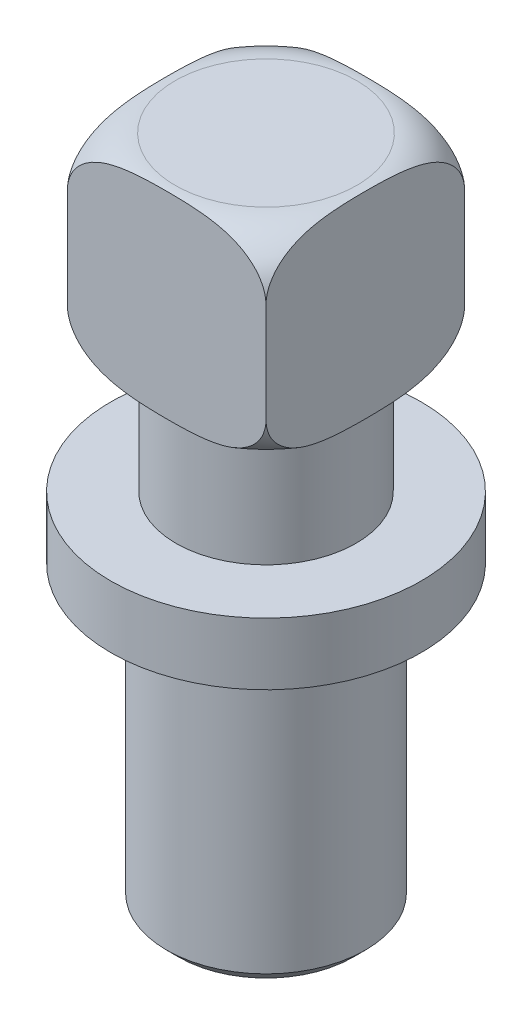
ISO-10303-21;
HEADER;
FILE_DESCRIPTION(('STEP AP214'),'2;1');
FILE_NAME('part.step','',(''),(''),'','','');
FILE_SCHEMA(('AUTOMOTIVE_DESIGN { 1 0 10303 214 1 1 1 1 }'));
ENDSEC;
DATA;
#1=APPLICATION_CONTEXT('core data for automotive mechanical design processes');
#2=APPLICATION_PROTOCOL_DEFINITION('international standard','automotive_design',2000,#1);
#3=PRODUCT_CONTEXT('',#1,'mechanical');
#4=PRODUCT('Part','Part','',(#3));
#5=PRODUCT_RELATED_PRODUCT_CATEGORY('part','',(#4));
#6=PRODUCT_DEFINITION_FORMATION('','',#4);
#7=PRODUCT_DEFINITION_CONTEXT('part definition',#1,'design');
#8=PRODUCT_DEFINITION('design','',#6,#7);
#9=PRODUCT_DEFINITION_SHAPE('','',#8);
#10=(LENGTH_UNIT() NAMED_UNIT(*) SI_UNIT(.MILLI.,.METRE.));
#11=(NAMED_UNIT(*) PLANE_ANGLE_UNIT() SI_UNIT($,.RADIAN.));
#12=(NAMED_UNIT(*) SI_UNIT($,.STERADIAN.) SOLID_ANGLE_UNIT());
#13=UNCERTAINTY_MEASURE_WITH_UNIT(LENGTH_MEASURE(1.E-05),#10,'distance_accuracy_value','');
#14=(GEOMETRIC_REPRESENTATION_CONTEXT(3) GLOBAL_UNCERTAINTY_ASSIGNED_CONTEXT((#13)) GLOBAL_UNIT_ASSIGNED_CONTEXT((#10,
#11,#12)) REPRESENTATION_CONTEXT('',''));
#15=CARTESIAN_POINT('',(0.,0.,0.));
#16=DIRECTION('',(0.,0.,1.));
#17=DIRECTION('',(1.,0.,0.));
#18=AXIS2_PLACEMENT_3D('',#15,#16,#17);
#19=CARTESIAN_POINT('',(-7.99999999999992,0.,7.99999999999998));
#20=DIRECTION('',(0.,1.,0.));
#21=DIRECTION('',(0.,0.,1.));
#22=AXIS2_PLACEMENT_3D('',#19,#20,#21);
#23=PLANE('',#22);
#24=CARTESIAN_POINT('',(0.,0.,0.));
#25=DIRECTION('',(0.,-1.,0.));
#26=DIRECTION('',(0.,0.,-1.));
#27=AXIS2_PLACEMENT_3D('',#24,#25,#26);
#28=CIRCLE('',#27,7.31370849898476);
#29=CARTESIAN_POINT('',(0.,0.,-7.31370849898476));
#30=VERTEX_POINT('',#29);
#31=EDGE_CURVE('E80',#30,#30,#28,.T.);
#32=ORIENTED_EDGE('',*,*,#31,.T.);
#33=EDGE_LOOP('',(#32));
#34=FACE_BOUND('',#33,.T.);
#35=CARTESIAN_POINT('',(0.,0.,0.));
#36=DIRECTION('',(0.,1.,0.));
#37=DIRECTION('',(0.,0.,1.));
#38=AXIS2_PLACEMENT_3D('',#35,#36,#37);
#39=CIRCLE('',#38,7.25);
#40=CARTESIAN_POINT('',(0.,0.,7.25));
#41=VERTEX_POINT('',#40);
#42=EDGE_CURVE('E103',#41,#41,#39,.F.);
#43=ORIENTED_EDGE('',*,*,#42,.F.);
#44=EDGE_LOOP('',(#43));
#45=FACE_BOUND('',#44,.T.);
#46=ADVANCED_FACE('F32',(#34,#45),#23,.F.);
#47=CARTESIAN_POINT('',(-8.00000000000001,16.,-8.00000000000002));
#48=DIRECTION('',(1.,0.,0.));
#49=DIRECTION('',(0.,0.,-1.));
#50=AXIS2_PLACEMENT_3D('',#47,#48,#49);
#51=PLANE('',#50);
#52=DIRECTION('',(0.,-1.,0.));
#53=VECTOR('',#52,1.);
#54=CARTESIAN_POINT('',(-8.00000000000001,16.,-8.00000000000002));
#55=LINE('',#54,#53);
#56=CARTESIAN_POINT('',(-7.99999999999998,12.,-8.00000000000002));
#57=VERTEX_POINT('',#56);
#58=CARTESIAN_POINT('',(-8.00000000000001,3.99999999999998,-8.00000000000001));
#59=VERTEX_POINT('',#58);
#60=EDGE_CURVE('E93',#57,#59,#55,.T.);
#61=ORIENTED_EDGE('',*,*,#60,.T.);
#62=CARTESIAN_POINT('',(-7.99999999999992,0.0593142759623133,0.));
#63=CARTESIAN_POINT('',(-7.99999999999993,0.059315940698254,0.146009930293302));
#64=CARTESIAN_POINT('',(-7.99999999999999,0.0600050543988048,0.292019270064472));
#65=CARTESIAN_POINT('',(-8.00000000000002,0.0628346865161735,0.584024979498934));
#66=CARTESIAN_POINT('',(-8.00000000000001,0.0649752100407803,0.730021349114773));
#67=CARTESIAN_POINT('',(-8.,0.0709087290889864,1.0220131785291));
#68=CARTESIAN_POINT('',(-8.,0.0747020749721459,1.16800863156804));
#69=CARTESIAN_POINT('',(-8.00000000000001,0.0842806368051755,1.45993374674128));
#70=CARTESIAN_POINT('',(-8.00000000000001,0.090065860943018,1.60586340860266));
#71=CARTESIAN_POINT('',(-8.,0.111070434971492,2.04375947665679));
#72=CARTESIAN_POINT('',(-8.00000000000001,0.129934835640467,2.33557091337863));
#73=CARTESIAN_POINT('',(-8.00000000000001,0.182232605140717,2.91786522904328));
#74=CARTESIAN_POINT('',(-8.00000000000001,0.21565925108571,3.20834865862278));
#75=CARTESIAN_POINT('',(-8.00000000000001,0.286848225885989,3.67729775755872));
#76=CARTESIAN_POINT('',(-8.00000000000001,0.318224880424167,3.85670718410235));
#77=CARTESIAN_POINT('',(-8.00000000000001,0.390786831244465,4.21351623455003));
#78=CARTESIAN_POINT('',(-8.00000000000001,0.431973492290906,4.39091557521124));
#79=CARTESIAN_POINT('',(-8.00000000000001,0.572832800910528,4.91796281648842));
#80=CARTESIAN_POINT('',(-8.00000000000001,0.689937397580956,5.26347778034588));
#81=CARTESIAN_POINT('',(-8.00000000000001,0.938676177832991,5.8238759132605));
#82=CARTESIAN_POINT('',(-8.00000000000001,1.05429627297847,6.04580321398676));
#83=CARTESIAN_POINT('',(-8.00000000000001,1.31814010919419,6.46957400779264));
#84=CARTESIAN_POINT('',(-8.00000000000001,1.46632645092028,6.67144015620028));
#85=CARTESIAN_POINT('',(-8.00000000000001,1.76172393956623,7.0048459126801));
#86=CARTESIAN_POINT('',(-8.00000000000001,1.90231423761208,7.14217954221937));
#87=CARTESIAN_POINT('',(-8.00000000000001,2.12849924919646,7.32962718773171));
#88=CARTESIAN_POINT('',(-8.00000000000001,2.20647811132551,7.38903746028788));
#89=CARTESIAN_POINT('',(-8.00000000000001,2.36726291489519,7.50089012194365));
#90=CARTESIAN_POINT('',(-8.00000000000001,2.45006664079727,7.55333567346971));
#91=CARTESIAN_POINT('',(-8.00000000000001,2.62091433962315,7.65095039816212));
#92=CARTESIAN_POINT('',(-8.00000000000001,2.70900059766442,7.69604576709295));
#93=CARTESIAN_POINT('',(-8.,2.88905240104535,7.77756795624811));
#94=CARTESIAN_POINT('',(-8.,2.98101585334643,7.81399938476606));
#95=CARTESIAN_POINT('',(-8.00000000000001,3.16808517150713,7.87753184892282));
#96=CARTESIAN_POINT('',(-8.00000000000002,3.26318966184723,7.90463691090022));
#97=CARTESIAN_POINT('',(-7.99999999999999,3.45562897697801,7.94900156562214));
#98=CARTESIAN_POINT('',(-7.99999999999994,3.55296341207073,7.96626286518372));
#99=CARTESIAN_POINT('',(-7.9999999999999,3.81862250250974,7.99918644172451));
#100=CARTESIAN_POINT('',(-8.,3.98827989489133,8.0050104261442));
#101=CARTESIAN_POINT('',(-8.00000000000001,4.32576428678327,7.98626783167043));
#102=CARTESIAN_POINT('',(-7.99999999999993,4.49359185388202,7.96171096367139));
#103=CARTESIAN_POINT('',(-7.99999999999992,4.81340840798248,7.88592128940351));
#104=CARTESIAN_POINT('',(-7.99999999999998,4.96576252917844,7.83621016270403));
#105=CARTESIAN_POINT('',(-8.00000000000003,5.26073866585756,7.71357922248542));
#106=CARTESIAN_POINT('',(-8.00000000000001,5.40336018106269,7.6406582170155));
#107=CARTESIAN_POINT('',(-8.00000000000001,5.68614140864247,7.46889709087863));
#108=CARTESIAN_POINT('',(-8.00000000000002,5.82539732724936,7.36857745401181));
#109=CARTESIAN_POINT('',(-7.99999999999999,6.08823525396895,7.14921042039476));
#110=CARTESIAN_POINT('',(-7.99999999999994,6.21180512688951,7.03014868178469));
#111=CARTESIAN_POINT('',(-7.9999999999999,6.50268458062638,6.71162048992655));
#112=CARTESIAN_POINT('',(-7.99999999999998,6.65942546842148,6.502486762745));
#113=CARTESIAN_POINT('',(-8.00000000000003,6.93735275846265,6.06201799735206));
#114=CARTESIAN_POINT('',(-8.00000000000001,7.05848487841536,5.8306497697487));
#115=CARTESIAN_POINT('',(-8.,7.24928919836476,5.40008777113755));
#116=CARTESIAN_POINT('',(-8.,7.32437447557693,5.20322510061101));
#117=CARTESIAN_POINT('',(-8.00000000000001,7.45700349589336,4.80359765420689));
#118=CARTESIAN_POINT('',(-8.00000000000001,7.51453439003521,4.600828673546));
#119=CARTESIAN_POINT('',(-8.00000000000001,7.61500962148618,4.1910179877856));
#120=CARTESIAN_POINT('',(-8.00000000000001,7.65790064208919,3.98396351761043));
#121=CARTESIAN_POINT('',(-8.00000000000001,7.7315784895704,3.56782736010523));
#122=CARTESIAN_POINT('',(-8.00000000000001,7.76236879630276,3.35874627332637));
#123=CARTESIAN_POINT('',(-8.00000000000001,7.81445248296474,2.93913559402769));
#124=CARTESIAN_POINT('',(-8.00000000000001,7.83573206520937,2.72860434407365));
#125=CARTESIAN_POINT('',(-8.00000000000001,7.87098833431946,2.30691591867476));
#126=CARTESIAN_POINT('',(-8.00000000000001,7.8849636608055,2.0957586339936));
#127=CARTESIAN_POINT('',(-8.00000000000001,7.90748614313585,1.6729869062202));
#128=CARTESIAN_POINT('',(-8.00000000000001,7.91602862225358,1.46137222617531));
#129=CARTESIAN_POINT('',(-8.00000000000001,7.92907683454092,1.03804035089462));
#130=CARTESIAN_POINT('',(-8.00000000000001,7.93358284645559,0.826323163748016));
#131=CARTESIAN_POINT('',(-8.00000000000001,7.93943311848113,0.402811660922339));
#132=CARTESIAN_POINT('',(-8.00000000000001,7.94077683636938,0.191017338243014));
#133=CARTESIAN_POINT('',(-8.00000000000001,7.94058521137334,-0.232577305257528));
#134=CARTESIAN_POINT('',(-8.00000000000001,7.93904976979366,-0.444377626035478));
#135=CARTESIAN_POINT('',(-8.00000000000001,7.93277775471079,-0.867806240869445));
#136=CARTESIAN_POINT('',(-8.00000000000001,7.92804311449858,-1.07943456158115));
#137=CARTESIAN_POINT('',(-8.00000000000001,7.91446517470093,-1.50255244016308));
#138=CARTESIAN_POINT('',(-8.00000000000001,7.90562214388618,-1.71404200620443));
#139=CARTESIAN_POINT('',(-8.00000000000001,7.88181353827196,-2.14719722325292));
#140=CARTESIAN_POINT('',(-8.00000000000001,7.86656651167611,-2.3688482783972));
#141=CARTESIAN_POINT('',(-8.00000000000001,7.82775277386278,-2.81148823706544));
#142=CARTESIAN_POINT('',(-8.,7.80418462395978,-3.03247701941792));
#143=CARTESIAN_POINT('',(-8.00000000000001,7.74611682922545,-3.47262050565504));
#144=CARTESIAN_POINT('',(-8.00000000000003,7.71163920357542,-3.69177799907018));
#145=CARTESIAN_POINT('',(-7.99999999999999,7.62874774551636,-4.1273960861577));
#146=CARTESIAN_POINT('',(-7.99999999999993,7.5803392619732,-4.34385768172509));
#147=CARTESIAN_POINT('',(-7.99999999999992,7.4441309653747,-4.85581578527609));
#148=CARTESIAN_POINT('',(-8.00000000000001,7.34833287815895,-5.14928782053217));
#149=CARTESIAN_POINT('',(-8.,7.11457053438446,-5.71936801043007));
#150=CARTESIAN_POINT('',(-7.9999999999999,6.97665380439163,-5.99599475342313));
#151=CARTESIAN_POINT('',(-7.99999999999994,6.69796794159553,-6.44377207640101));
#152=CARTESIAN_POINT('',(-8.00000000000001,6.56934807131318,-6.62242795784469));
#153=CARTESIAN_POINT('',(-8.,6.28550314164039,-6.95727656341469));
#154=CARTESIAN_POINT('',(-7.99999999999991,6.1303151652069,-7.11350004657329));
#155=CARTESIAN_POINT('',(-7.99999999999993,5.82373557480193,-7.37043309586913));
#156=CARTESIAN_POINT('',(-8.00000000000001,5.67649461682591,-7.47607404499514));
#157=CARTESIAN_POINT('',(-8.00000000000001,5.36645768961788,-7.66159011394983));
#158=CARTESIAN_POINT('',(-7.99999999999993,5.20366674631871,-7.74147352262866));
#159=CARTESIAN_POINT('',(-7.99999999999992,4.86528876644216,-7.87125409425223));
#160=CARTESIAN_POINT('',(-7.99999999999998,4.68963069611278,-7.92096812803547));
#161=CARTESIAN_POINT('',(-8.00000000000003,4.33206890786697,-7.98625170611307));
#162=CARTESIAN_POINT('',(-8.00000000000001,4.1501682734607,-8.00183786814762));
#163=CARTESIAN_POINT('',(-8.,3.8059041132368,-7.99802267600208));
#164=CARTESIAN_POINT('',(-8.00000000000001,3.64349153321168,-7.98211787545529));
#165=CARTESIAN_POINT('',(-8.00000000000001,3.32374770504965,-7.9230706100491));
#166=CARTESIAN_POINT('',(-8.,3.16641577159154,-7.87993183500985));
#167=CARTESIAN_POINT('',(-8.00000000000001,2.8616390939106,-7.76903176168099));
#168=CARTESIAN_POINT('',(-8.00000000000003,2.71415023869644,-7.70139047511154));
#169=CARTESIAN_POINT('',(-7.99999999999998,2.43110443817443,-7.54466906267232));
#170=CARTESIAN_POINT('',(-7.99999999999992,2.29555135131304,-7.4555820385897));
#171=CARTESIAN_POINT('',(-7.99999999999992,2.02395836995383,-7.24870613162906));
#172=CARTESIAN_POINT('',(-8.,1.88951163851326,-7.12883598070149));
#173=CARTESIAN_POINT('',(-8.00000000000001,1.6384471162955,-6.87183038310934));
#174=CARTESIAN_POINT('',(-7.99999999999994,1.52183747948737,-6.73468709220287));
#175=CARTESIAN_POINT('',(-7.99999999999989,1.2389534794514,-6.35766112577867));
#176=CARTESIAN_POINT('',(-7.99999999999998,1.08700707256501,-6.10700787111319));
#177=CARTESIAN_POINT('',(-8.00000000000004,0.824390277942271,-5.58498066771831));
#178=CARTESIAN_POINT('',(-8.00000000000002,0.71383132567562,-5.31355311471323));
#179=CARTESIAN_POINT('',(-8.,0.515672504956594,-4.72606514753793));
#180=CARTESIAN_POINT('',(-8.00000000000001,0.432441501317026,-4.40856639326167));
#181=CARTESIAN_POINT('',(-8.00000000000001,0.331824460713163,-3.9273603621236));
#182=CARTESIAN_POINT('',(-8.00000000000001,0.302304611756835,-3.76595181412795));
#183=CARTESIAN_POINT('',(-8.00000000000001,0.250116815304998,-3.44202595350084));
#184=CARTESIAN_POINT('',(-8.00000000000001,0.227448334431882,-3.27950872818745));
#185=CARTESIAN_POINT('',(-8.00000000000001,0.187722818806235,-2.95322750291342));
#186=CARTESIAN_POINT('',(-8.00000000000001,0.170685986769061,-2.78946112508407));
#187=CARTESIAN_POINT('',(-8.00000000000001,0.141261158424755,-2.46152075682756));
#188=CARTESIAN_POINT('',(-8.,0.128873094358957,-2.29734677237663));
#189=CARTESIAN_POINT('',(-8.00000000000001,0.107818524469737,-1.96888563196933));
#190=CARTESIAN_POINT('',(-8.00000000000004,0.0991493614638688,-1.80459864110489));
#191=CARTESIAN_POINT('',(-7.99999999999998,0.084743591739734,-1.47590305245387));
#192=CARTESIAN_POINT('',(-7.9999999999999,0.0790069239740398,-1.31149445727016));
#193=CARTESIAN_POINT('',(-7.99999999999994,0.0717855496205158,-1.05141158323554));
#194=CARTESIAN_POINT('',(-7.99999999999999,0.0695260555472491,-0.95575752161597));
#195=CARTESIAN_POINT('',(-8.00000000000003,0.0657173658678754,-0.764435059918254));
#196=CARTESIAN_POINT('',(-8.00000000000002,0.0641681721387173,-0.668766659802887));
#197=CARTESIAN_POINT('',(-7.99999999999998,0.0604867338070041,-0.382073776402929));
#198=CARTESIAN_POINT('',(-7.99999999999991,0.0593120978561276,-0.191036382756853));
#199=CARTESIAN_POINT('',(-7.99999999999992,0.0593142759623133,0.));
#200=B_SPLINE_CURVE_WITH_KNOTS('',3,(#62,#63,#64,#65,#66,#67,#68,#69,#70,#71,#72,#73,#74,#75,
#76,#77,#78,#79,#80,#81,#82,#83,#84,#85,#86,#87,#88,#89,#90,#91,#92,#93,#94,#95,#96,#97,#98,#99,
#100,#101,#102,#103,#104,#105,#106,#107,#108,#109,#110,#111,#112,#113,#114,#115,#116,#117,#118,
#119,#120,#121,#122,#123,#124,#125,#126,#127,#128,#129,#130,#131,#132,#133,#134,#135,#136,#137,
#138,#139,#140,#141,#142,#143,#144,#145,#146,#147,#148,#149,#150,#151,#152,#153,#154,#155,#156,
#157,#158,#159,#160,#161,#162,#163,#164,#165,#166,#167,#168,#169,#170,#171,#172,#173,#174,#175,
#176,#177,#178,#179,#180,#181,#182,#183,#184,#185,#186,#187,#188,#189,#190,#191,#192,#193,#194,
#195,#196,#197,#198,#199),.UNSPECIFIED.,.T.,.F.,(4,2,2,2,2,2,2,2,2,2,2,2,2,2,2,2,2,2,2,2,2,2,2,
2,2,2,2,2,2,2,2,2,2,2,2,2,2,2,2,2,2,2,2,2,2,2,2,2,2,2,2,2,2,2,2,2,2,2,2,2,2,2,2,2,2,2,2,2,4),
(0.,0.438026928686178,0.876055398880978,1.31417676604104,1.75229993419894,2.62933219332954,
3.50595998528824,4.05209238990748,4.59830081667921,5.68765549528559,6.4361202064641,
7.18372982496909,7.77083467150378,8.06461998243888,8.35827143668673,8.65471064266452,
8.95099182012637,9.24714492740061,9.54324666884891,10.0495983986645,10.5557883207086,
11.0344788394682,11.5131939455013,12.0261090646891,12.5394186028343,13.3190428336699,
14.0998494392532,14.7310249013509,15.3626612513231,15.9965739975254,16.6303043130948,
17.2649510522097,17.8997159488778,18.5350265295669,19.1702932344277,19.8056688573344,
20.4410662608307,21.0760800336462,21.7110522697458,22.3774621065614,23.0439872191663,
23.7091755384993,24.3741087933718,25.2978042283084,26.2204611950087,26.8786470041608,
27.5359215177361,28.0773643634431,28.6186327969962,29.1631547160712,29.7074114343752,
30.194612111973,30.6817467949,31.1665270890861,31.6514635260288,32.1898506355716,
32.7284831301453,33.6027371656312,34.4793284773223,35.4614951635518,35.9536620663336,
36.4457906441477,36.939665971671,37.4335341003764,37.9270487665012,38.4205531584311,
38.7075930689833,38.9946337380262,39.5677391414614),.UNSPECIFIED.);
#201=CARTESIAN_POINT('',(-7.99999999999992,3.99999999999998,7.99999999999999));
#202=VERTEX_POINT('',#201);
#203=EDGE_CURVE('E48',#59,#202,#200,.T.);
#204=ORIENTED_EDGE('',*,*,#203,.T.);
#205=DIRECTION('',(0.,-1.,0.));
#206=VECTOR('',#205,1.);
#207=CARTESIAN_POINT('',(-7.99999999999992,16.,7.99999999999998));
#208=LINE('',#207,#206);
#209=CARTESIAN_POINT('',(-7.99999999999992,12.,7.99999999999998));
#210=VERTEX_POINT('',#209);
#211=EDGE_CURVE('E95',#210,#202,#208,.T.);
#212=ORIENTED_EDGE('',*,*,#211,.F.);
#213=CARTESIAN_POINT('',(-8.00000009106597,15.9406858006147,0.));
#214=CARTESIAN_POINT('',(-8.000000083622,15.9406841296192,-0.146009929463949));
#215=CARTESIAN_POINT('',(-8.00000002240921,15.9399949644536,-0.292019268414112));
#216=CARTESIAN_POINT('',(-7.99999997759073,15.9371652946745,-0.584024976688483));
#217=CARTESIAN_POINT('',(-7.99999999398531,15.9350247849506,-0.730021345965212));
#218=CARTESIAN_POINT('',(-8.00000000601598,15.9290912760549,-1.02201317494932));
#219=CARTESIAN_POINT('',(-8.00000000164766,15.9252979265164,-1.16800862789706));
#220=CARTESIAN_POINT('',(-7.99999999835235,15.9157193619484,-1.45993374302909));
#221=CARTESIAN_POINT('',(-7.99999999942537,15.9099341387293,-1.6058634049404));
#222=CARTESIAN_POINT('',(-8.0000000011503,15.8889295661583,-2.04375947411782));
#223=CARTESIAN_POINT('',(-8.00000000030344,15.8700651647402,-2.33557091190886));
#224=CARTESIAN_POINT('',(-7.99999999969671,15.8177673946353,-2.91786522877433));
#225=CARTESIAN_POINT('',(-7.99999999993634,15.7843407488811,-3.20834865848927));
#226=CARTESIAN_POINT('',(-8.00000000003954,15.7131517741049,-3.67729775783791));
#227=CARTESIAN_POINT('',(-8.00000000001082,15.6817751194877,-3.85670718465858));
#228=CARTESIAN_POINT('',(-7.99999999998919,15.6092131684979,-4.21351623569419));
#229=CARTESIAN_POINT('',(-7.99999999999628,15.5680265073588,-4.39091557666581));
#230=CARTESIAN_POINT('',(-8.00000000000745,15.427167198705,-4.91796281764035));
#231=CARTESIAN_POINT('',(-8.00000000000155,15.3100626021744,-5.26347778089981));
#232=CARTESIAN_POINT('',(-7.99999999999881,15.0613238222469,-5.82387591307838));
#233=CARTESIAN_POINT('',(-7.99999999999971,14.945703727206,-6.04580321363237));
#234=CARTESIAN_POINT('',(-8.0000000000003,14.6818598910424,-6.46957400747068));
#235=CARTESIAN_POINT('',(-7.99999999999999,14.5336735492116,-6.67144015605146));
#236=CARTESIAN_POINT('',(-7.99999999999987,14.2382760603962,-7.00484591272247));
#237=CARTESIAN_POINT('',(-7.99999999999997,14.0976857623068,-7.14217954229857));
#238=CARTESIAN_POINT('',(-8.00000000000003,13.8715007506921,-7.32962718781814));
#239=CARTESIAN_POINT('',(-8.00000000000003,13.7935218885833,-7.38903746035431));
#240=CARTESIAN_POINT('',(-7.99999999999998,13.6327370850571,-7.5008901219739));
#241=CARTESIAN_POINT('',(-7.99999999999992,13.5499333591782,-7.55333567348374));
#242=CARTESIAN_POINT('',(-7.99999999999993,13.3790856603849,-7.65095039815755));
#243=CARTESIAN_POINT('',(-7.99999999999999,13.2909994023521,-7.6960457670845));
#244=CARTESIAN_POINT('',(-8.00000000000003,13.1109475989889,-7.77756795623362));
#245=CARTESIAN_POINT('',(-8.00000000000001,13.0189841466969,-7.81399938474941));
#246=CARTESIAN_POINT('',(-8.00000000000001,12.8319148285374,-7.87753184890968));
#247=CARTESIAN_POINT('',(-8.00000000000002,12.7368103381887,-7.90463691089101));
#248=CARTESIAN_POINT('',(-7.99999999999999,12.5443710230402,-7.94900156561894));
#249=CARTESIAN_POINT('',(-7.99999999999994,12.4470365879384,-7.96626286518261));
#250=CARTESIAN_POINT('',(-7.9999999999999,12.181377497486,-7.99918644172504));
#251=CARTESIAN_POINT('',(-7.99999999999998,12.0117201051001,-8.0050104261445));
#252=CARTESIAN_POINT('',(-8.00000000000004,11.6742357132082,-7.98626783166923));
#253=CARTESIAN_POINT('',(-8.00000000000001,11.5064081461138,-7.96171096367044));
#254=CARTESIAN_POINT('',(-8.00000000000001,11.1865915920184,-7.88592128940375));
#255=CARTESIAN_POINT('',(-8.00000000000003,11.0342374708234,-7.83621016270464));
#256=CARTESIAN_POINT('',(-7.99999999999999,10.7392613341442,-7.71357922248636));
#257=CARTESIAN_POINT('',(-7.99999999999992,10.5966398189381,-7.64065821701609));
#258=CARTESIAN_POINT('',(-7.99999999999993,10.3138585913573,-7.46889709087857));
#259=CARTESIAN_POINT('',(-8.,10.1746026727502,-7.36857745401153));
#260=CARTESIAN_POINT('',(-8.00000000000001,9.91176474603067,-7.14921042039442));
#261=CARTESIAN_POINT('',(-7.99999999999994,9.78819487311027,-7.03014868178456));
#262=CARTESIAN_POINT('',(-7.9999999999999,9.49731541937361,-6.71162048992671));
#263=CARTESIAN_POINT('',(-8.,9.34057453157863,-6.50248676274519));
#264=CARTESIAN_POINT('',(-8.00000000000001,9.06264724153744,-6.06201799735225));
#265=CARTESIAN_POINT('',(-7.99999999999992,8.94151512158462,-5.83064976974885));
#266=CARTESIAN_POINT('',(-7.99999999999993,8.75071080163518,-5.4000877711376));
#267=CARTESIAN_POINT('',(-7.99999999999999,8.67562552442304,-5.20322510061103));
#268=CARTESIAN_POINT('',(-8.00000000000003,8.54299650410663,-4.80359765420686));
#269=CARTESIAN_POINT('',(-8.00000000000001,8.48546560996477,-4.60082867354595));
#270=CARTESIAN_POINT('',(-8.00000000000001,8.38499037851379,-4.19101798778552));
#271=CARTESIAN_POINT('',(-8.00000000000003,8.34209935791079,-3.98396351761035));
#272=CARTESIAN_POINT('',(-7.99999999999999,8.26842151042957,-3.56782736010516));
#273=CARTESIAN_POINT('',(-7.99999999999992,8.23763120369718,-3.3587462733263));
#274=CARTESIAN_POINT('',(-7.99999999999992,8.1855475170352,-2.93913559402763));
#275=CARTESIAN_POINT('',(-7.99999999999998,8.1642679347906,-2.72860434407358));
#276=CARTESIAN_POINT('',(-8.00000000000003,8.12901166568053,-2.3069159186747));
#277=CARTESIAN_POINT('',(-8.00000000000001,8.11503633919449,-2.09575863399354));
#278=CARTESIAN_POINT('',(-8.,8.09251385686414,-1.67298690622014));
#279=CARTESIAN_POINT('',(-8.00000000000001,8.08397137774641,-1.46137222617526));
#280=CARTESIAN_POINT('',(-8.00000000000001,8.07092316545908,-1.03804035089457));
#281=CARTESIAN_POINT('',(-8.00000000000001,8.0664171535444,-0.82632316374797));
#282=CARTESIAN_POINT('',(-8.00000000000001,8.06056688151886,-0.402811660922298));
#283=CARTESIAN_POINT('',(-8.00000000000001,8.05922316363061,-0.191017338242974));
#284=CARTESIAN_POINT('',(-8.00000000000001,8.05941478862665,0.232577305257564));
#285=CARTESIAN_POINT('',(-8.00000000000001,8.06095023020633,0.444377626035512));
#286=CARTESIAN_POINT('',(-8.00000000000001,8.06722224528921,0.867806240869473));
#287=CARTESIAN_POINT('',(-8.00000000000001,8.07195688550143,1.07943456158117));
#288=CARTESIAN_POINT('',(-8.00000000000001,8.08553482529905,1.5025524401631));
#289=CARTESIAN_POINT('',(-8.00000000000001,8.09437785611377,1.71404200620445));
#290=CARTESIAN_POINT('',(-8.00000000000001,8.11818646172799,2.14719722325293));
#291=CARTESIAN_POINT('',(-8.00000000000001,8.13343348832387,2.3688482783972));
#292=CARTESIAN_POINT('',(-8.00000000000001,8.17224722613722,2.81148823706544));
#293=CARTESIAN_POINT('',(-8.00000000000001,8.19581537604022,3.03247701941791));
#294=CARTESIAN_POINT('',(-8.00000000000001,8.25388317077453,3.47262050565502));
#295=CARTESIAN_POINT('',(-8.00000000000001,8.28836079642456,3.69177799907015));
#296=CARTESIAN_POINT('',(-8.00000000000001,8.37125225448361,4.12739608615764));
#297=CARTESIAN_POINT('',(-8.00000000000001,8.41966073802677,4.34385768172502));
#298=CARTESIAN_POINT('',(-8.00000000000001,8.55586903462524,4.85581578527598));
#299=CARTESIAN_POINT('',(-8.00000000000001,8.65166712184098,5.14928782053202));
#300=CARTESIAN_POINT('',(-8.00000000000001,8.88542946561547,5.71936801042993));
#301=CARTESIAN_POINT('',(-8.00000000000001,9.02334619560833,5.99599475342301));
#302=CARTESIAN_POINT('',(-8.00000000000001,9.3020320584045,6.44377207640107));
#303=CARTESIAN_POINT('',(-8.00000000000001,9.43065192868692,6.62242795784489));
#304=CARTESIAN_POINT('',(-8.00000000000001,9.71449685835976,6.95727656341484));
#305=CARTESIAN_POINT('',(-8.00000000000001,9.86968483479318,7.11350004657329));
#306=CARTESIAN_POINT('',(-8.00000000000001,10.1762644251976,7.37043309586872));
#307=CARTESIAN_POINT('',(-8.00000000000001,10.3235053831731,7.47607404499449));
#308=CARTESIAN_POINT('',(-8.,10.6335423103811,7.66159011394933));
#309=CARTESIAN_POINT('',(-8.,10.7963332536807,7.74147352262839));
#310=CARTESIAN_POINT('',(-8.00000000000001,11.1347112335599,7.87125409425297));
#311=CARTESIAN_POINT('',(-8.00000000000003,11.3103693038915,7.92096812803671));
#312=CARTESIAN_POINT('',(-7.99999999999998,11.6679310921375,7.98625170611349));
#313=CARTESIAN_POINT('',(-7.99999999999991,11.8498317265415,8.00183786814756));
#314=CARTESIAN_POINT('',(-7.99999999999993,12.194095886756,7.99802267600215));
#315=CARTESIAN_POINT('',(-8.00000000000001,12.3565084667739,7.98211787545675));
#316=CARTESIAN_POINT('',(-8.,12.6762522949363,7.92307061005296));
#317=CARTESIAN_POINT('',(-7.99999999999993,12.8335842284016,7.8799318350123));
#318=CARTESIAN_POINT('',(-7.99999999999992,13.1383609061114,7.76903176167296));
#319=CARTESIAN_POINT('',(-7.99999999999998,13.2858497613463,7.70139047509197));
#320=CARTESIAN_POINT('',(-8.00000000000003,13.5688955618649,7.54466906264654));
#321=CARTESIAN_POINT('',(-8.00000000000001,13.7044486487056,7.45558203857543));
#322=CARTESIAN_POINT('',(-8.,13.9760416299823,7.24870613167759));
#323=CARTESIAN_POINT('',(-8.,14.1104883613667,7.1288359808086));
#324=CARTESIAN_POINT('',(-8.00000000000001,14.3615528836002,6.871830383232));
#325=CARTESIAN_POINT('',(-8.00000000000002,14.4781625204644,6.73468709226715));
#326=CARTESIAN_POINT('',(-7.99999999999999,14.7610465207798,6.35766112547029));
#327=CARTESIAN_POINT('',(-7.99999999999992,14.9129929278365,6.1070078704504));
#328=CARTESIAN_POINT('',(-8.00000000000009,15.1756097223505,5.58498066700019));
#329=CARTESIAN_POINT('',(-8.00000000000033,15.2861686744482,5.31355311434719));
#330=CARTESIAN_POINT('',(-7.99999999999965,15.4843274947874,4.72606514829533));
#331=CARTESIAN_POINT('',(-7.99999999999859,15.5675584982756,4.4085663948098));
#332=CARTESIAN_POINT('',(-8.00000000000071,15.6681755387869,3.92736036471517));
#333=CARTESIAN_POINT('',(-8.00000000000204,15.6976953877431,3.76595181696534));
#334=CARTESIAN_POINT('',(-7.99999999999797,15.7498831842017,3.44202595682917));
#335=CARTESIAN_POINT('',(-7.99999999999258,15.7725516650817,3.2795087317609));
#336=CARTESIAN_POINT('',(-8.00000000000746,15.8122771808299,2.95322750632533));
#337=CARTESIAN_POINT('',(-8.00000000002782,15.8293140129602,2.78946112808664));
#338=CARTESIAN_POINT('',(-7.99999999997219,15.8587388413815,2.46152075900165));
#339=CARTESIAN_POINT('',(-7.99999999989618,15.8711269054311,2.29734677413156));
#340=CARTESIAN_POINT('',(-8.00000000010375,15.8921814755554,1.96888563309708));
#341=CARTESIAN_POINT('',(-8.00000000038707,15.9008506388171,1.8045986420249));
#342=CARTESIAN_POINT('',(-7.99999999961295,15.9152564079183,1.47590305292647));
#343=CARTESIAN_POINT('',(-7.99999999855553,15.9209930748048,1.31149445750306));
#344=CARTESIAN_POINT('',(-8.00000000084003,15.9282144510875,1.05141158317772));
#345=CARTESIAN_POINT('',(-8.0000000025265,15.9304739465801,0.95575752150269));
#346=CARTESIAN_POINT('',(-7.9999999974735,15.9342826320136,0.764435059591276));
#347=CARTESIAN_POINT('',(-7.999999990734,15.935831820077,0.66876665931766));
#348=CARTESIAN_POINT('',(-8.0000000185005,15.9395132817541,0.382073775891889));
#349=CARTESIAN_POINT('',(-8.0000001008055,15.9406879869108,0.191036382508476));
#350=CARTESIAN_POINT('',(-8.00000009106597,15.9406858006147,0.));
#351=B_SPLINE_CURVE_WITH_KNOTS('',3,(#213,#214,#215,#216,#217,#218,#219,#220,#221,#222,#223,
#224,#225,#226,#227,#228,#229,#230,#231,#232,#233,#234,#235,#236,#237,#238,#239,#240,#241,#242,
#243,#244,#245,#246,#247,#248,#249,#250,#251,#252,#253,#254,#255,#256,#257,#258,#259,#260,#261,
#262,#263,#264,#265,#266,#267,#268,#269,#270,#271,#272,#273,#274,#275,#276,#277,#278,#279,#280,
#281,#282,#283,#284,#285,#286,#287,#288,#289,#290,#291,#292,#293,#294,#295,#296,#297,#298,#299,
#300,#301,#302,#303,#304,#305,#306,#307,#308,#309,#310,#311,#312,#313,#314,#315,#316,#317,#318,
#319,#320,#321,#322,#323,#324,#325,#326,#327,#328,#329,#330,#331,#332,#333,#334,#335,#336,#337,
#338,#339,#340,#341,#342,#343,#344,#345,#346,#347,#348,#349,#350),.UNSPECIFIED.,.T.,.F.,(4,2,2,
2,2,2,2,2,2,2,2,2,2,2,2,2,2,2,2,2,2,2,2,2,2,2,2,2,2,2,2,2,2,2,2,2,2,2,2,2,2,2,2,2,2,2,2,2,2,2,2,
2,2,2,2,2,2,2,2,2,2,2,2,2,2,2,2,2,4),(0.,0.438026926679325,0.876055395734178,1.31417676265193,
1.7522999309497,2.62933219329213,3.50595998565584,4.05209239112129,4.59830081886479,
5.68765549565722,6.43612020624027,7.18372982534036,7.77083467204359,8.06461998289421,
8.35827143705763,8.65471064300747,8.95099182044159,9.24714492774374,9.5432466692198,
10.0495983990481,10.5557883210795,11.0344788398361,11.5131939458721,12.0261090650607,
12.5394186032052,13.3190428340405,14.099849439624,14.7310249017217,15.362661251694,
15.9965739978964,16.6303043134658,17.2649510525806,17.8997159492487,18.5350265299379,
19.1702932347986,19.8056688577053,20.4410662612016,21.0760800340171,21.7110522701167,
22.3774621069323,23.0439872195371,23.7091755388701,24.3741087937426,25.297804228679,
26.2204611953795,26.878647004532,27.5359215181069,28.0773643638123,28.618632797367,
29.1631547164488,29.7074114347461,30.1946121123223,30.6817467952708,31.166527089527,
31.6514635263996,32.1898506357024,32.7284831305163,33.602737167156,34.4793284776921,
35.4614951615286,35.9536620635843,36.4457906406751,36.9396659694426,37.4335340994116,
37.9270487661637,38.4205531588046,38.7075930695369,38.9946337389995,39.5677391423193),.UNSPECIFIED.);
#352=EDGE_CURVE('E97',#210,#57,#351,.T.);
#353=ORIENTED_EDGE('',*,*,#352,.T.);
#354=EDGE_LOOP('',(#61,#204,#212,#353));
#355=FACE_BOUND('',#354,.T.);
#356=ADVANCED_FACE('F34',(#355),#51,.F.);
#357=CARTESIAN_POINT('',(-7.99999999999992,16.,7.99999999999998));
#358=DIRECTION('',(0.,0.,-1.));
#359=DIRECTION('',(-1.,0.,0.));
#360=AXIS2_PLACEMENT_3D('',#357,#358,#359);
#361=PLANE('',#360);
#362=ORIENTED_EDGE('',*,*,#211,.T.);
#363=CARTESIAN_POINT('',(0.,0.0593142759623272,8.));
#364=CARTESIAN_POINT('',(0.146009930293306,0.0593159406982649,7.99999999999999));
#365=CARTESIAN_POINT('',(0.292019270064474,0.0600050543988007,7.99999999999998));
#366=CARTESIAN_POINT('',(0.584024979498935,0.0628346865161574,7.99999999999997));
#367=CARTESIAN_POINT('',(0.730021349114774,0.0649752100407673,7.99999999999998));
#368=CARTESIAN_POINT('',(1.0220131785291,0.0709087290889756,7.99999999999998));
#369=CARTESIAN_POINT('',(1.16800863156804,0.0747020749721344,7.99999999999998));
#370=CARTESIAN_POINT('',(1.45993374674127,0.0842806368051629,7.99999999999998));
#371=CARTESIAN_POINT('',(1.60586340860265,0.090065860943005,7.99999999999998));
#372=CARTESIAN_POINT('',(2.04375947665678,0.111070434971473,7.99999999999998));
#373=CARTESIAN_POINT('',(2.33557091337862,0.129934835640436,7.99999999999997));
#374=CARTESIAN_POINT('',(2.91786522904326,0.182232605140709,7.99999999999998));
#375=CARTESIAN_POINT('',(3.20834865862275,0.215659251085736,7.99999999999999));
#376=CARTESIAN_POINT('',(3.6772977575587,0.286848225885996,7.99999999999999));
#377=CARTESIAN_POINT('',(3.85670718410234,0.318224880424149,7.99999999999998));
#378=CARTESIAN_POINT('',(4.21351623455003,0.390786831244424,7.99999999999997));
#379=CARTESIAN_POINT('',(4.39091557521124,0.431973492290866,7.99999999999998));
#380=CARTESIAN_POINT('',(4.91796281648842,0.572832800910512,7.99999999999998));
#381=CARTESIAN_POINT('',(5.26347778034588,0.689937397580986,7.99999999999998));
#382=CARTESIAN_POINT('',(5.82387591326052,0.938676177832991,7.99999999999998));
#383=CARTESIAN_POINT('',(6.0458032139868,1.05429627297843,7.99999999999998));
#384=CARTESIAN_POINT('',(6.46957400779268,1.31814010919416,7.99999999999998));
#385=CARTESIAN_POINT('',(6.67144015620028,1.46632645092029,7.99999999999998));
#386=CARTESIAN_POINT('',(7.0048459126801,1.76172393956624,7.99999999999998));
#387=CARTESIAN_POINT('',(7.1421795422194,1.90231423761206,7.99999999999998));
#388=CARTESIAN_POINT('',(7.32962718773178,2.12849924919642,7.99999999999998));
#389=CARTESIAN_POINT('',(7.38903746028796,2.20647811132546,7.99999999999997));
#390=CARTESIAN_POINT('',(7.5008901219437,2.36726291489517,7.99999999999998));
#391=CARTESIAN_POINT('',(7.5533356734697,2.45006664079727,7.99999999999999));
#392=CARTESIAN_POINT('',(7.65095039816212,2.62091433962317,7.99999999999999));
#393=CARTESIAN_POINT('',(7.69604576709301,2.70900059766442,7.99999999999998));
#394=CARTESIAN_POINT('',(7.7775679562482,2.88905240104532,7.99999999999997));
#395=CARTESIAN_POINT('',(7.81399938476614,2.98101585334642,7.99999999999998));
#396=CARTESIAN_POINT('',(7.8775318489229,3.16808517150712,7.99999999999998));
#397=CARTESIAN_POINT('',(7.90463691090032,3.26318966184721,7.99999999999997));
#398=CARTESIAN_POINT('',(7.94900156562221,3.455628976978,7.99999999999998));
#399=CARTESIAN_POINT('',(7.96626286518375,3.55296341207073,8.));
#400=CARTESIAN_POINT('',(7.9991864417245,3.81862250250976,8.00000000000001));
#401=CARTESIAN_POINT('',(8.00501042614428,3.98827989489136,7.99999999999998));
#402=CARTESIAN_POINT('',(7.98626783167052,4.32576428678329,7.99999999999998));
#403=CARTESIAN_POINT('',(7.9617109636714,4.49359185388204,8.00000000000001));
#404=CARTESIAN_POINT('',(7.88592128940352,4.81340840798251,8.00000000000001));
#405=CARTESIAN_POINT('',(7.83621016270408,4.96576252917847,7.99999999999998));
#406=CARTESIAN_POINT('',(7.71357922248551,5.26073866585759,7.99999999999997));
#407=CARTESIAN_POINT('',(7.64065821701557,5.40336018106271,7.99999999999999));
#408=CARTESIAN_POINT('',(7.46889709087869,5.68614140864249,8.));
#409=CARTESIAN_POINT('',(7.36857745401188,5.82539732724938,7.99999999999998));
#410=CARTESIAN_POINT('',(7.14921042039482,6.08823525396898,7.99999999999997));
#411=CARTESIAN_POINT('',(7.03014868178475,6.21180512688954,7.99999999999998));
#412=CARTESIAN_POINT('',(6.71162048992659,6.50268458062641,7.99999999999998));
#413=CARTESIAN_POINT('',(6.50248676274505,6.65942546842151,7.99999999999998));
#414=CARTESIAN_POINT('',(6.06201799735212,6.93735275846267,7.99999999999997));
#415=CARTESIAN_POINT('',(5.83064976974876,7.05848487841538,7.99999999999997));
#416=CARTESIAN_POINT('',(5.4000877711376,7.24928919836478,7.99999999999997));
#417=CARTESIAN_POINT('',(5.20322510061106,7.32437447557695,7.99999999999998));
#418=CARTESIAN_POINT('',(4.80359765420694,7.45700349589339,7.99999999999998));
#419=CARTESIAN_POINT('',(4.60082867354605,7.51453439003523,7.99999999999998));
#420=CARTESIAN_POINT('',(4.19101798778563,7.6150096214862,7.99999999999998));
#421=CARTESIAN_POINT('',(3.98396351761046,7.65790064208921,7.99999999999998));
#422=CARTESIAN_POINT('',(3.56782736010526,7.73157848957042,7.99999999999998));
#423=CARTESIAN_POINT('',(3.35874627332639,7.76236879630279,7.99999999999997));
#424=CARTESIAN_POINT('',(2.93913559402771,7.81445248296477,7.99999999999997));
#425=CARTESIAN_POINT('',(2.72860434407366,7.83573206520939,7.99999999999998));
#426=CARTESIAN_POINT('',(2.30691591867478,7.87098833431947,7.99999999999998));
#427=CARTESIAN_POINT('',(2.09575863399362,7.88496366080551,7.99999999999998));
#428=CARTESIAN_POINT('',(1.67298690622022,7.90748614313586,7.99999999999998));
#429=CARTESIAN_POINT('',(1.46137222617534,7.91602862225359,7.99999999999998));
#430=CARTESIAN_POINT('',(1.03804035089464,7.92907683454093,7.99999999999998));
#431=CARTESIAN_POINT('',(0.826323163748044,7.9335828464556,7.99999999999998));
#432=CARTESIAN_POINT('',(0.402811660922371,7.93943311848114,7.99999999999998));
#433=CARTESIAN_POINT('',(0.191017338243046,7.94077683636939,7.99999999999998));
#434=CARTESIAN_POINT('',(-0.232577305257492,7.94058521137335,7.99999999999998));
#435=CARTESIAN_POINT('',(-0.44437762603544,7.93904976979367,7.99999999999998));
#436=CARTESIAN_POINT('',(-0.867806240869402,7.9327777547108,7.99999999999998));
#437=CARTESIAN_POINT('',(-1.0794345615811,7.92804311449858,7.99999999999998));
#438=CARTESIAN_POINT('',(-1.50255244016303,7.91446517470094,7.99999999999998));
#439=CARTESIAN_POINT('',(-1.71404200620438,7.9056221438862,7.99999999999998));
#440=CARTESIAN_POINT('',(-2.14719722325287,7.88181353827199,7.99999999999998));
#441=CARTESIAN_POINT('',(-2.36884827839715,7.86656651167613,7.99999999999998));
#442=CARTESIAN_POINT('',(-2.81148823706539,7.8277527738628,7.99999999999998));
#443=CARTESIAN_POINT('',(-3.03247701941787,7.8041846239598,7.99999999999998));
#444=CARTESIAN_POINT('',(-3.47262050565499,7.74611682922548,7.99999999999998));
#445=CARTESIAN_POINT('',(-3.69177799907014,7.71163920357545,7.99999999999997));
#446=CARTESIAN_POINT('',(-4.12739608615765,7.62874774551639,7.99999999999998));
#447=CARTESIAN_POINT('',(-4.34385768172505,7.58033926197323,7.99999999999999));
#448=CARTESIAN_POINT('',(-4.85581578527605,7.44413096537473,7.99999999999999));
#449=CARTESIAN_POINT('',(-5.14928782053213,7.34833287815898,7.99999999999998));
#450=CARTESIAN_POINT('',(-5.71936801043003,7.11457053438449,7.99999999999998));
#451=CARTESIAN_POINT('',(-5.99599475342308,6.97665380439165,8.));
#452=CARTESIAN_POINT('',(-6.44377207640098,6.69796794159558,7.99999999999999));
#453=CARTESIAN_POINT('',(-6.62242795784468,6.56934807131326,7.99999999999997));
#454=CARTESIAN_POINT('',(-6.95727656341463,6.28550314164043,7.99999999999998));
#455=CARTESIAN_POINT('',(-7.11350004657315,6.13031516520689,8.00000000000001));
#456=CARTESIAN_POINT('',(-7.37043309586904,5.82373557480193,8.00000000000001));
#457=CARTESIAN_POINT('',(-7.47607404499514,5.67649461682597,7.99999999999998));
#458=CARTESIAN_POINT('',(-7.66159011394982,5.36645768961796,7.99999999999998));
#459=CARTESIAN_POINT('',(-7.74147352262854,5.20366674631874,8.00000000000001));
#460=CARTESIAN_POINT('',(-7.87125409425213,4.86528876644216,8.00000000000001));
#461=CARTESIAN_POINT('',(-7.92096812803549,4.68963069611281,7.99999999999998));
#462=CARTESIAN_POINT('',(-7.9862517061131,4.332068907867,7.99999999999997));
#463=CARTESIAN_POINT('',(-8.00183786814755,4.15016827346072,7.99999999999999));
#464=CARTESIAN_POINT('',(-7.99802267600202,3.80590411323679,7.99999999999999));
#465=CARTESIAN_POINT('',(-7.98211787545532,3.64349153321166,7.99999999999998));
#466=CARTESIAN_POINT('',(-7.92307061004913,3.32374770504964,7.99999999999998));
#467=CARTESIAN_POINT('',(-7.87993183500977,3.16641577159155,7.99999999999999));
#468=CARTESIAN_POINT('',(-7.7690317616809,2.86163909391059,7.99999999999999));
#469=CARTESIAN_POINT('',(-7.70139047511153,2.7141502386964,7.99999999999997));
#470=CARTESIAN_POINT('',(-7.54466906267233,2.43110443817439,7.99999999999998));
#471=CARTESIAN_POINT('',(-7.45558203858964,2.29555135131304,8.00000000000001));
#472=CARTESIAN_POINT('',(-7.24870613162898,2.02395836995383,8.00000000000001));
#473=CARTESIAN_POINT('',(-7.12883598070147,1.88951163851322,7.99999999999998));
#474=CARTESIAN_POINT('',(-6.87183038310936,1.63844711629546,7.99999999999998));
#475=CARTESIAN_POINT('',(-6.73468709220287,1.52183747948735,8.));
#476=CARTESIAN_POINT('',(-6.35766112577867,1.2389534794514,8.00000000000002));
#477=CARTESIAN_POINT('',(-6.10700787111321,1.08700707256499,7.99999999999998));
#478=CARTESIAN_POINT('',(-5.58498066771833,0.824390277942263,7.99999999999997));
#479=CARTESIAN_POINT('',(-5.31355311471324,0.713831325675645,8.));
#480=CARTESIAN_POINT('',(-4.72606514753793,0.515672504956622,8.00000000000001));
#481=CARTESIAN_POINT('',(-4.40856639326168,0.432441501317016,7.99999999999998));
#482=CARTESIAN_POINT('',(-3.9273603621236,0.331824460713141,7.99999999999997));
#483=CARTESIAN_POINT('',(-3.76595181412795,0.302304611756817,7.99999999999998));
#484=CARTESIAN_POINT('',(-3.44202595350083,0.250116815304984,7.99999999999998));
#485=CARTESIAN_POINT('',(-3.27950872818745,0.227448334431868,7.99999999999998));
#486=CARTESIAN_POINT('',(-2.95322750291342,0.187722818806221,7.99999999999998));
#487=CARTESIAN_POINT('',(-2.78946112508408,0.170685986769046,7.99999999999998));
#488=CARTESIAN_POINT('',(-2.46152075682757,0.141261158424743,7.99999999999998));
#489=CARTESIAN_POINT('',(-2.29734677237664,0.128873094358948,7.99999999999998));
#490=CARTESIAN_POINT('',(-1.96888563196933,0.107818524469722,7.99999999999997));
#491=CARTESIAN_POINT('',(-1.80459864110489,0.0991493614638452,7.99999999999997));
#492=CARTESIAN_POINT('',(-1.47590305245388,0.0847435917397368,7.99999999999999));
#493=CARTESIAN_POINT('',(-1.31149445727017,0.0790069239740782,8.00000000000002));
#494=CARTESIAN_POINT('',(-1.05141158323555,0.0717855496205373,8.));
#495=CARTESIAN_POINT('',(-0.955757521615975,0.0695260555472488,7.99999999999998));
#496=CARTESIAN_POINT('',(-0.764435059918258,0.0657173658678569,7.99999999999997));
#497=CARTESIAN_POINT('',(-0.66876665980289,0.0641681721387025,7.99999999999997));
#498=CARTESIAN_POINT('',(-0.382073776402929,0.0604867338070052,7.99999999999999));
#499=CARTESIAN_POINT('',(-0.191036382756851,0.0593120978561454,8.));
#500=CARTESIAN_POINT('',(0.,0.0593142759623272,8.));
#501=B_SPLINE_CURVE_WITH_KNOTS('',3,(#363,#364,#365,#366,#367,#368,#369,#370,#371,#372,#373,
#374,#375,#376,#377,#378,#379,#380,#381,#382,#383,#384,#385,#386,#387,#388,#389,#390,#391,#392,
#393,#394,#395,#396,#397,#398,#399,#400,#401,#402,#403,#404,#405,#406,#407,#408,#409,#410,#411,
#412,#413,#414,#415,#416,#417,#418,#419,#420,#421,#422,#423,#424,#425,#426,#427,#428,#429,#430,
#431,#432,#433,#434,#435,#436,#437,#438,#439,#440,#441,#442,#443,#444,#445,#446,#447,#448,#449,
#450,#451,#452,#453,#454,#455,#456,#457,#458,#459,#460,#461,#462,#463,#464,#465,#466,#467,#468,
#469,#470,#471,#472,#473,#474,#475,#476,#477,#478,#479,#480,#481,#482,#483,#484,#485,#486,#487,
#488,#489,#490,#491,#492,#493,#494,#495,#496,#497,#498,#499,#500),.UNSPECIFIED.,.T.,.F.,(4,2,2,
2,2,2,2,2,2,2,2,2,2,2,2,2,2,2,2,2,2,2,2,2,2,2,2,2,2,2,2,2,2,2,2,2,2,2,2,2,2,2,2,2,2,2,2,2,2,2,2,
2,2,2,2,2,2,2,2,2,2,2,2,2,2,2,2,2,4),(0.,0.438026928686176,0.876055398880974,1.31417676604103,
1.75229993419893,2.62933219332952,3.50595998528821,4.05209238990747,4.5983008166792,
5.6876554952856,6.43612020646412,7.18372982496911,7.7708346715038,8.0646199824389,
8.35827143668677,8.65471064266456,8.95099182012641,9.24714492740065,9.54324666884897,
10.0495983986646,10.5557883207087,11.0344788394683,11.5131939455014,12.0261090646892,
12.5394186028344,13.31904283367,14.0998494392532,14.7310249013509,15.3626612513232,
15.9965739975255,16.6303043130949,17.2649510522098,17.8997159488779,18.535026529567,
19.1702932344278,19.8056688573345,20.4410662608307,21.0760800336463,21.7110522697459,
22.3774621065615,23.0439872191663,23.7091755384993,24.3741087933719,25.2978042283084,
26.2204611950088,26.8786470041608,27.5359215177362,28.0773643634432,28.6186327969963,
29.1631547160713,29.7074114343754,30.1946121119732,30.6817467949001,31.1665270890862,
31.6514635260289,32.1898506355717,32.7284831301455,33.6027371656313,34.4793284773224,
35.4614951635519,35.9536620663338,36.4457906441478,36.9396659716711,37.4335341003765,
37.9270487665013,38.4205531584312,38.7075930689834,38.9946337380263,39.5677391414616),.UNSPECIFIED.);
#502=CARTESIAN_POINT('',(8.00000000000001,4.,8.00000000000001));
#503=VERTEX_POINT('',#502);
#504=EDGE_CURVE('E89',#202,#503,#501,.T.);
#505=ORIENTED_EDGE('',*,*,#504,.T.);
#506=DIRECTION('',(0.,-1.,0.));
#507=VECTOR('',#506,1.);
#508=CARTESIAN_POINT('',(8.00000000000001,16.,7.99999999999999));
#509=LINE('',#508,#507);
#510=CARTESIAN_POINT('',(8.00000000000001,12.,8.));
#511=VERTEX_POINT('',#510);
#512=EDGE_CURVE('E88',#511,#503,#509,.T.);
#513=ORIENTED_EDGE('',*,*,#512,.F.);
#514=CARTESIAN_POINT('',(0.,15.9406857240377,7.99999999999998));
#515=CARTESIAN_POINT('',(-0.146009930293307,15.9406840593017,7.99999999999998));
#516=CARTESIAN_POINT('',(-0.292019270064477,15.9399949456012,7.99999999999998));
#517=CARTESIAN_POINT('',(-0.58402497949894,15.9371653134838,7.99999999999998));
#518=CARTESIAN_POINT('',(-0.73002134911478,15.9350247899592,7.99999999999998));
#519=CARTESIAN_POINT('',(-1.02201317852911,15.929091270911,7.99999999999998));
#520=CARTESIAN_POINT('',(-1.16800863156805,15.9252979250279,7.99999999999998));
#521=CARTESIAN_POINT('',(-1.45993374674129,15.9157193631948,7.99999999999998));
#522=CARTESIAN_POINT('',(-1.60586340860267,15.909934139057,7.99999999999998));
#523=CARTESIAN_POINT('',(-2.04375947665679,15.8889295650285,7.99999999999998));
#524=CARTESIAN_POINT('',(-2.33557091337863,15.8700651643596,7.99999999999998));
#525=CARTESIAN_POINT('',(-2.91786522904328,15.8177673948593,7.99999999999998));
#526=CARTESIAN_POINT('',(-3.20834865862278,15.7843407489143,7.99999999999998));
#527=CARTESIAN_POINT('',(-3.67729775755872,15.713151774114,7.99999999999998));
#528=CARTESIAN_POINT('',(-3.85670718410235,15.6817751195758,7.99999999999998));
#529=CARTESIAN_POINT('',(-4.21351623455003,15.6092131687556,7.99999999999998));
#530=CARTESIAN_POINT('',(-4.39091557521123,15.5680265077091,7.99999999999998));
#531=CARTESIAN_POINT('',(-4.91796281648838,15.4271671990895,7.99999999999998));
#532=CARTESIAN_POINT('',(-5.2634777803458,15.310062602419,8.));
#533=CARTESIAN_POINT('',(-5.82387591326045,15.061323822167,7.99999999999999));
#534=CARTESIAN_POINT('',(-6.04580321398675,14.9457037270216,7.99999999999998));
#535=CARTESIAN_POINT('',(-6.46957400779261,14.6818598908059,7.99999999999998));
#536=CARTESIAN_POINT('',(-6.67144015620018,14.5336735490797,7.99999999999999));
#537=CARTESIAN_POINT('',(-7.00484591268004,14.2382760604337,7.99999999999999));
#538=CARTESIAN_POINT('',(-7.14217954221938,14.0976857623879,7.99999999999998));
#539=CARTESIAN_POINT('',(-7.32962718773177,13.8715007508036,7.99999999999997));
#540=CARTESIAN_POINT('',(-7.38903746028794,13.7935218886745,7.99999999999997));
#541=CARTESIAN_POINT('',(-7.50089012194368,13.6327370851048,7.99999999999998));
#542=CARTESIAN_POINT('',(-7.5533356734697,13.5499333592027,7.99999999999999));
#543=CARTESIAN_POINT('',(-7.65095039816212,13.3790856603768,7.99999999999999));
#544=CARTESIAN_POINT('',(-7.696045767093,13.2909994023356,7.99999999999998));
#545=CARTESIAN_POINT('',(-7.77756795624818,13.1109475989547,7.99999999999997));
#546=CARTESIAN_POINT('',(-7.81399938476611,13.0189841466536,7.99999999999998));
#547=CARTESIAN_POINT('',(-7.87753184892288,12.8319148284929,7.99999999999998));
#548=CARTESIAN_POINT('',(-7.90463691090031,12.7368103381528,7.99999999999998));
#549=CARTESIAN_POINT('',(-7.94900156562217,12.544371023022,7.99999999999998));
#550=CARTESIAN_POINT('',(-7.96626286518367,12.4470365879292,7.99999999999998));
#551=CARTESIAN_POINT('',(-7.9991864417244,12.1813774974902,7.99999999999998));
#552=CARTESIAN_POINT('',(-8.00501042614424,12.0117201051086,7.99999999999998));
#553=CARTESIAN_POINT('',(-7.98626783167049,11.6742357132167,7.99999999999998));
#554=CARTESIAN_POINT('',(-7.96171096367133,11.5064081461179,7.99999999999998));
#555=CARTESIAN_POINT('',(-7.88592128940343,11.1865915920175,7.99999999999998));
#556=CARTESIAN_POINT('',(-7.83621016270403,11.0342374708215,7.99999999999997));
#557=CARTESIAN_POINT('',(-7.71357922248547,10.7392613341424,7.99999999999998));
#558=CARTESIAN_POINT('',(-7.64065821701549,10.5966398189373,7.99999999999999));
#559=CARTESIAN_POINT('',(-7.4688970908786,10.3138585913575,7.99999999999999));
#560=CARTESIAN_POINT('',(-7.36857745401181,10.1746026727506,7.99999999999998));
#561=CARTESIAN_POINT('',(-7.14921042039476,9.91176474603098,7.99999999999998));
#562=CARTESIAN_POINT('',(-7.03014868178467,9.78819487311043,7.99999999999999));
#563=CARTESIAN_POINT('',(-6.7116204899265,9.49731541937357,8.));
#564=CARTESIAN_POINT('',(-6.50248676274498,9.34057453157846,7.99999999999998));
#565=CARTESIAN_POINT('',(-6.06201799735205,9.0626472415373,7.99999999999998));
#566=CARTESIAN_POINT('',(-5.83064976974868,8.94151512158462,7.99999999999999));
#567=CARTESIAN_POINT('',(-5.40008777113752,8.75071080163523,7.99999999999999));
#568=CARTESIAN_POINT('',(-5.20322510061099,8.67562552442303,7.99999999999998));
#569=CARTESIAN_POINT('',(-4.80359765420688,8.5429965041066,7.99999999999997));
#570=CARTESIAN_POINT('',(-4.60082867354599,8.48546560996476,7.99999999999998));
#571=CARTESIAN_POINT('',(-4.19101798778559,8.3849903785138,7.99999999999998));
#572=CARTESIAN_POINT('',(-3.98396351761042,8.34209935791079,7.99999999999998));
#573=CARTESIAN_POINT('',(-3.56782736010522,8.26842151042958,7.99999999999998));
#574=CARTESIAN_POINT('',(-3.35874627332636,8.23763120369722,7.99999999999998));
#575=CARTESIAN_POINT('',(-2.93913559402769,8.18554751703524,7.99999999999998));
#576=CARTESIAN_POINT('',(-2.72860434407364,8.16426793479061,7.99999999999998));
#577=CARTESIAN_POINT('',(-2.30691591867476,8.12901166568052,7.99999999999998));
#578=CARTESIAN_POINT('',(-2.0957586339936,8.11503633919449,7.99999999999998));
#579=CARTESIAN_POINT('',(-1.6729869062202,8.09251385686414,7.99999999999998));
#580=CARTESIAN_POINT('',(-1.46137222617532,8.08397137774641,7.99999999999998));
#581=CARTESIAN_POINT('',(-1.03804035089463,8.07092316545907,7.99999999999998));
#582=CARTESIAN_POINT('',(-0.826323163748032,8.0664171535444,7.99999999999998));
#583=CARTESIAN_POINT('',(-0.402811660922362,8.06056688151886,7.99999999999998));
#584=CARTESIAN_POINT('',(-0.191017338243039,8.05922316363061,7.99999999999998));
#585=CARTESIAN_POINT('',(0.232577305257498,8.05941478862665,7.99999999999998));
#586=CARTESIAN_POINT('',(0.444377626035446,8.06095023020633,7.99999999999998));
#587=CARTESIAN_POINT('',(0.867806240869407,8.0672222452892,7.99999999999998));
#588=CARTESIAN_POINT('',(1.07943456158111,8.07195688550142,7.99999999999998));
#589=CARTESIAN_POINT('',(1.50255244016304,8.08553482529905,7.99999999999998));
#590=CARTESIAN_POINT('',(1.71404200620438,8.0943778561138,7.99999999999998));
#591=CARTESIAN_POINT('',(2.14719722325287,8.11818646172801,7.99999999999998));
#592=CARTESIAN_POINT('',(2.36884827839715,8.13343348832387,7.99999999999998));
#593=CARTESIAN_POINT('',(2.81148823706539,8.1722472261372,7.99999999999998));
#594=CARTESIAN_POINT('',(3.03247701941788,8.1958153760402,7.99999999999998));
#595=CARTESIAN_POINT('',(3.472620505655,8.25388317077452,7.99999999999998));
#596=CARTESIAN_POINT('',(3.69177799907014,8.28836079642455,7.99999999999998));
#597=CARTESIAN_POINT('',(4.12739608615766,8.37125225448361,7.99999999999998));
#598=CARTESIAN_POINT('',(4.34385768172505,8.41966073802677,7.99999999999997));
#599=CARTESIAN_POINT('',(4.85581578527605,8.55586903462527,7.99999999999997));
#600=CARTESIAN_POINT('',(5.14928782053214,8.65166712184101,7.99999999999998));
#601=CARTESIAN_POINT('',(5.71936801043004,8.8854294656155,7.99999999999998));
#602=CARTESIAN_POINT('',(5.99599475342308,9.02334619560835,7.99999999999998));
#603=CARTESIAN_POINT('',(6.44377207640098,9.30203205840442,7.99999999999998));
#604=CARTESIAN_POINT('',(6.62242795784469,9.43065192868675,7.99999999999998));
#605=CARTESIAN_POINT('',(6.95727656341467,9.71449685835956,7.99999999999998));
#606=CARTESIAN_POINT('',(7.11350004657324,9.86968483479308,7.99999999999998));
#607=CARTESIAN_POINT('',(7.37043309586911,10.176264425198,7.99999999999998));
#608=CARTESIAN_POINT('',(7.47607404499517,10.323505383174,7.99999999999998));
#609=CARTESIAN_POINT('',(7.66159011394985,10.6335423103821,7.99999999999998));
#610=CARTESIAN_POINT('',(7.74147352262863,10.7963332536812,7.99999999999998));
#611=CARTESIAN_POINT('',(7.87125409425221,11.1347112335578,7.99999999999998));
#612=CARTESIAN_POINT('',(7.92096812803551,11.3103693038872,7.99999999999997));
#613=CARTESIAN_POINT('',(7.98625170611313,11.667931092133,7.99999999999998));
#614=CARTESIAN_POINT('',(8.00183786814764,11.8498317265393,7.99999999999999));
#615=CARTESIAN_POINT('',(7.9980226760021,12.1940958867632,7.99999999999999));
#616=CARTESIAN_POINT('',(7.98211787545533,12.3565084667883,7.99999999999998));
#617=CARTESIAN_POINT('',(7.92307061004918,12.6762522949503,7.99999999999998));
#618=CARTESIAN_POINT('',(7.87993183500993,12.8335842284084,7.99999999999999));
#619=CARTESIAN_POINT('',(7.76903176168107,13.1383609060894,7.99999999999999));
#620=CARTESIAN_POINT('',(7.70139047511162,13.2858497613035,7.99999999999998));
#621=CARTESIAN_POINT('',(7.54466906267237,13.5688955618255,7.99999999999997));
#622=CARTESIAN_POINT('',(7.45558203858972,13.7044486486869,7.99999999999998));
#623=CARTESIAN_POINT('',(7.24870613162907,13.9760416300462,7.99999999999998));
#624=CARTESIAN_POINT('',(7.12883598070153,14.1104883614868,7.99999999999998));
#625=CARTESIAN_POINT('',(6.87183038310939,14.3615528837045,7.99999999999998));
#626=CARTESIAN_POINT('',(6.73468709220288,14.4781625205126,7.99999999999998));
#627=CARTESIAN_POINT('',(6.35766112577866,14.7610465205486,7.99999999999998));
#628=CARTESIAN_POINT('',(6.10700787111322,14.912992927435,7.99999999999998));
#629=CARTESIAN_POINT('',(5.58498066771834,15.1756097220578,7.99999999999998));
#630=CARTESIAN_POINT('',(5.31355311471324,15.2861686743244,7.99999999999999));
#631=CARTESIAN_POINT('',(4.72606514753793,15.4843274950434,7.99999999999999));
#632=CARTESIAN_POINT('',(4.40856639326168,15.567558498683,7.99999999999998));
#633=CARTESIAN_POINT('',(3.9273603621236,15.6681755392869,7.99999999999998));
#634=CARTESIAN_POINT('',(3.76595181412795,15.6976953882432,7.99999999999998));
#635=CARTESIAN_POINT('',(3.44202595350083,15.749883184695,7.99999999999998));
#636=CARTESIAN_POINT('',(3.27950872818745,15.7725516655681,7.99999999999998));
#637=CARTESIAN_POINT('',(2.95322750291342,15.8122771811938,7.99999999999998));
#638=CARTESIAN_POINT('',(2.78946112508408,15.829314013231,7.99999999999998));
#639=CARTESIAN_POINT('',(2.46152075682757,15.8587388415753,7.99999999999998));
#640=CARTESIAN_POINT('',(2.29734677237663,15.8711269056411,7.99999999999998));
#641=CARTESIAN_POINT('',(1.96888563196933,15.8921814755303,7.99999999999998));
#642=CARTESIAN_POINT('',(1.80459864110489,15.9008506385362,7.99999999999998));
#643=CARTESIAN_POINT('',(1.47590305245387,15.9152564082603,7.99999999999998));
#644=CARTESIAN_POINT('',(1.31149445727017,15.9209930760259,7.99999999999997));
#645=CARTESIAN_POINT('',(1.05141158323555,15.9282144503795,7.99999999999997));
#646=CARTESIAN_POINT('',(0.955757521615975,15.9304739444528,7.99999999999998));
#647=CARTESIAN_POINT('',(0.764435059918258,15.9342826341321,7.99999999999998));
#648=CARTESIAN_POINT('',(0.66876665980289,15.9358318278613,7.99999999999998));
#649=CARTESIAN_POINT('',(0.382073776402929,15.939513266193,7.99999999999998));
#650=CARTESIAN_POINT('',(0.191036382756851,15.9406879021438,7.99999999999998));
#651=CARTESIAN_POINT('',(0.,15.9406857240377,7.99999999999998));
#652=B_SPLINE_CURVE_WITH_KNOTS('',3,(#514,#515,#516,#517,#518,#519,#520,#521,#522,#523,#524,
#525,#526,#527,#528,#529,#530,#531,#532,#533,#534,#535,#536,#537,#538,#539,#540,#541,#542,#543,
#544,#545,#546,#547,#548,#549,#550,#551,#552,#553,#554,#555,#556,#557,#558,#559,#560,#561,#562,
#563,#564,#565,#566,#567,#568,#569,#570,#571,#572,#573,#574,#575,#576,#577,#578,#579,#580,#581,
#582,#583,#584,#585,#586,#587,#588,#589,#590,#591,#592,#593,#594,#595,#596,#597,#598,#599,#600,
#601,#602,#603,#604,#605,#606,#607,#608,#609,#610,#611,#612,#613,#614,#615,#616,#617,#618,#619,
#620,#621,#622,#623,#624,#625,#626,#627,#628,#629,#630,#631,#632,#633,#634,#635,#636,#637,#638,
#639,#640,#641,#642,#643,#644,#645,#646,#647,#648,#649,#650,#651),.UNSPECIFIED.,.T.,.F.,(4,2,2,
2,2,2,2,2,2,2,2,2,2,2,2,2,2,2,2,2,2,2,2,2,2,2,2,2,2,2,2,2,2,2,2,2,2,2,2,2,2,2,2,2,2,2,2,2,2,2,2,
2,2,2,2,2,2,2,2,2,2,2,2,2,2,2,2,2,4),(0.,0.43802692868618,0.876055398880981,1.31417676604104,
1.75229993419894,2.62933219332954,3.50595998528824,4.05209238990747,4.59830081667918,
5.68765549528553,6.43612020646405,7.18372982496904,7.77083467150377,8.06461998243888,
8.35827143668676,8.65471064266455,8.95099182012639,9.24714492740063,9.54324666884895,
10.0495983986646,10.5557883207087,11.0344788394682,11.5131939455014,12.0261090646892,
12.5394186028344,13.31904283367,14.0998494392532,14.7310249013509,15.3626612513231,
15.9965739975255,16.6303043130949,17.2649510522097,17.8997159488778,18.535026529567,
19.1702932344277,19.8056688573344,20.4410662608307,21.0760800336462,21.7110522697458,
22.3774621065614,23.0439872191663,23.7091755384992,24.3741087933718,25.2978042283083,
26.2204611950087,26.8786470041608,27.5359215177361,28.0773643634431,28.6186327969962,
29.1631547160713,29.7074114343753,30.1946121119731,30.6817467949,31.1665270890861,
31.6514635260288,32.1898506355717,32.7284831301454,33.6027371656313,34.4793284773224,
35.4614951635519,35.9536620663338,36.4457906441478,36.9396659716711,37.4335341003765,
37.9270487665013,38.4205531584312,38.7075930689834,38.9946337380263,39.5677391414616),.UNSPECIFIED.);
#653=EDGE_CURVE('E182',#511,#210,#652,.T.);
#654=ORIENTED_EDGE('',*,*,#653,.T.);
#655=EDGE_LOOP('',(#362,#505,#513,#654));
#656=FACE_BOUND('',#655,.T.);
#657=ADVANCED_FACE('F128',(#656),#361,.F.);
#658=CARTESIAN_POINT('',(8.00000000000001,16.,-8.00000000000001));
#659=DIRECTION('',(-1.,0.,0.));
#660=DIRECTION('',(0.,0.,1.));
#661=AXIS2_PLACEMENT_3D('',#658,#659,#660);
#662=PLANE('',#661);
#663=ORIENTED_EDGE('',*,*,#512,.T.);
#664=CARTESIAN_POINT('',(8.00000000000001,0.0593142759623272,0.));
#665=CARTESIAN_POINT('',(8.00000000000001,0.0593159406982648,-0.14600993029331));
#666=CARTESIAN_POINT('',(8.00000000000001,0.0600050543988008,-0.29201927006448));
#667=CARTESIAN_POINT('',(8.00000000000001,0.0628346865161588,-0.584024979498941));
#668=CARTESIAN_POINT('',(8.00000000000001,0.0649752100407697,-0.730021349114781));
#669=CARTESIAN_POINT('',(8.00000000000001,0.0709087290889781,-1.02201317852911));
#670=CARTESIAN_POINT('',(8.00000000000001,0.0747020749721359,-1.16800863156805));
#671=CARTESIAN_POINT('',(8.00000000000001,0.0842806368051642,-1.45993374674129));
#672=CARTESIAN_POINT('',(8.00000000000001,0.090065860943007,-1.60586340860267));
#673=CARTESIAN_POINT('',(8.00000000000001,0.111070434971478,-2.04375947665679));
#674=CARTESIAN_POINT('',(8.00000000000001,0.129934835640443,-2.33557091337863));
#675=CARTESIAN_POINT('',(8.00000000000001,0.182232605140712,-2.91786522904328));
#676=CARTESIAN_POINT('',(8.00000000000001,0.215659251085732,-3.20834865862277));
#677=CARTESIAN_POINT('',(8.00000000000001,0.286848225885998,-3.67729775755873));
#678=CARTESIAN_POINT('',(8.00000000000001,0.318224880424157,-3.85670718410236));
#679=CARTESIAN_POINT('',(8.00000000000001,0.390786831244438,-4.21351623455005));
#680=CARTESIAN_POINT('',(8.00000000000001,0.431973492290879,-4.39091557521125));
#681=CARTESIAN_POINT('',(8.00000000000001,0.57283280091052,-4.91796281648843));
#682=CARTESIAN_POINT('',(8.00000000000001,0.689937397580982,-5.26347778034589));
#683=CARTESIAN_POINT('',(8.,0.938676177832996,-5.82387591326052));
#684=CARTESIAN_POINT('',(7.99999999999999,1.05429627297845,-6.0458032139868));
#685=CARTESIAN_POINT('',(8.00000000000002,1.31814010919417,-6.46957400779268));
#686=CARTESIAN_POINT('',(8.00000000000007,1.46632645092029,-6.67144015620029));
#687=CARTESIAN_POINT('',(8.00000000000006,1.76172393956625,-7.00484591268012));
#688=CARTESIAN_POINT('',(8.00000000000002,1.90231423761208,-7.14217954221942));
#689=CARTESIAN_POINT('',(8.,2.12849924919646,-7.32962718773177));
#690=CARTESIAN_POINT('',(8.00000000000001,2.20647811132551,-7.38903746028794));
#691=CARTESIAN_POINT('',(8.00000000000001,2.3672629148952,-7.50089012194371));
#692=CARTESIAN_POINT('',(8.00000000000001,2.45006664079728,-7.55333567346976));
#693=CARTESIAN_POINT('',(8.00000000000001,2.62091433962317,-7.65095039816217));
#694=CARTESIAN_POINT('',(8.00000000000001,2.70900059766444,-7.69604576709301));
#695=CARTESIAN_POINT('',(8.00000000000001,2.88905240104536,-7.77756795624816));
#696=CARTESIAN_POINT('',(8.00000000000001,2.98101585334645,-7.81399938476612));
#697=CARTESIAN_POINT('',(8.00000000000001,3.16808517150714,-7.87753184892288));
#698=CARTESIAN_POINT('',(8.00000000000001,3.26318966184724,-7.90463691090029));
#699=CARTESIAN_POINT('',(8.00000000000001,3.45562897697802,-7.94900156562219));
#700=CARTESIAN_POINT('',(8.00000000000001,3.55296341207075,-7.96626286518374));
#701=CARTESIAN_POINT('',(8.00000000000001,3.81862250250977,-7.9991864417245));
#702=CARTESIAN_POINT('',(8.00000000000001,3.98827989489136,-8.00501042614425));
#703=CARTESIAN_POINT('',(8.00000000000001,4.32576428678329,-7.98626783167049));
#704=CARTESIAN_POINT('',(8.00000000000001,4.49359185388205,-7.9617109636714));
#705=CARTESIAN_POINT('',(8.00000000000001,4.8134084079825,-7.88592128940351));
#706=CARTESIAN_POINT('',(8.00000000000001,4.96576252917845,-7.83621016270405));
#707=CARTESIAN_POINT('',(8.00000000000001,5.26073866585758,-7.71357922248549));
#708=CARTESIAN_POINT('',(8.00000000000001,5.40336018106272,-7.64065821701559));
#709=CARTESIAN_POINT('',(8.00000000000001,5.68614140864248,-7.46889709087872));
#710=CARTESIAN_POINT('',(8.00000000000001,5.82539732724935,-7.36857745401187));
#711=CARTESIAN_POINT('',(8.00000000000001,6.08823525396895,-7.14921042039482));
#712=CARTESIAN_POINT('',(8.00000000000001,6.21180512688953,-7.03014868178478));
#713=CARTESIAN_POINT('',(8.,6.50268458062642,-6.71162048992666));
#714=CARTESIAN_POINT('',(7.99999999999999,6.65942546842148,-6.50248676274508));
#715=CARTESIAN_POINT('',(8.00000000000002,6.93735275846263,-6.06201799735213));
#716=CARTESIAN_POINT('',(8.00000000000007,7.05848487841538,-5.8306497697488));
#717=CARTESIAN_POINT('',(8.00000000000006,7.24928919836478,-5.40008777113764));
#718=CARTESIAN_POINT('',(8.00000000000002,7.32437447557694,-5.20322510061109));
#719=CARTESIAN_POINT('',(7.99999999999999,7.45700349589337,-4.80359765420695));
#720=CARTESIAN_POINT('',(8.,7.51453439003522,-4.60082867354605));
#721=CARTESIAN_POINT('',(8.00000000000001,7.6150096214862,-4.19101798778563));
#722=CARTESIAN_POINT('',(8.00000000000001,7.65790064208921,-3.98396351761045));
#723=CARTESIAN_POINT('',(8.00000000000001,7.73157848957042,-3.56782736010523));
#724=CARTESIAN_POINT('',(8.00000000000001,7.76236879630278,-3.35874627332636));
#725=CARTESIAN_POINT('',(8.00000000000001,7.81445248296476,-2.93913559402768));
#726=CARTESIAN_POINT('',(8.00000000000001,7.83573206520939,-2.72860434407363));
#727=CARTESIAN_POINT('',(8.00000000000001,7.87098833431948,-2.30691591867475));
#728=CARTESIAN_POINT('',(8.00000000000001,7.88496366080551,-2.0957586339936));
#729=CARTESIAN_POINT('',(8.00000000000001,7.90748614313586,-1.6729869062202));
#730=CARTESIAN_POINT('',(8.00000000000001,7.91602862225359,-1.46137222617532));
#731=CARTESIAN_POINT('',(8.00000000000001,7.92907683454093,-1.03804035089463));
#732=CARTESIAN_POINT('',(8.00000000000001,7.9335828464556,-0.826323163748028));
#733=CARTESIAN_POINT('',(8.00000000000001,7.93943311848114,-0.402811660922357));
#734=CARTESIAN_POINT('',(8.00000000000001,7.94077683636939,-0.191017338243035));
#735=CARTESIAN_POINT('',(8.00000000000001,7.94058521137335,0.232577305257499));
#736=CARTESIAN_POINT('',(8.00000000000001,7.93904976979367,0.444377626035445));
#737=CARTESIAN_POINT('',(8.00000000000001,7.9327777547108,0.867806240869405));
#738=CARTESIAN_POINT('',(8.00000000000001,7.92804311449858,1.07943456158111));
#739=CARTESIAN_POINT('',(8.00000000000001,7.91446517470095,1.50255244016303));
#740=CARTESIAN_POINT('',(8.00000000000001,7.9056221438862,1.71404200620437));
#741=CARTESIAN_POINT('',(8.00000000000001,7.88181353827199,2.14719722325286));
#742=CARTESIAN_POINT('',(8.00000000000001,7.86656651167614,2.36884827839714));
#743=CARTESIAN_POINT('',(8.00000000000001,7.8277527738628,2.81148823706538));
#744=CARTESIAN_POINT('',(8.00000000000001,7.8041846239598,3.03247701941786));
#745=CARTESIAN_POINT('',(8.00000000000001,7.74611682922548,3.47262050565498));
#746=CARTESIAN_POINT('',(7.99999999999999,7.71163920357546,3.69177799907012));
#747=CARTESIAN_POINT('',(8.00000000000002,7.62874774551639,4.12739608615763));
#748=CARTESIAN_POINT('',(8.00000000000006,7.58033926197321,4.34385768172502));
#749=CARTESIAN_POINT('',(8.00000000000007,7.44413096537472,4.85581578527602));
#750=CARTESIAN_POINT('',(8.00000000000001,7.348332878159,5.14928782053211));
#751=CARTESIAN_POINT('',(8.00000000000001,7.11457053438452,5.71936801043));
#752=CARTESIAN_POINT('',(8.00000000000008,6.97665380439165,5.99599475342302));
#753=CARTESIAN_POINT('',(8.00000000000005,6.69796794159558,6.44377207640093));
#754=CARTESIAN_POINT('',(8.,6.56934807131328,6.62242795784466));
#755=CARTESIAN_POINT('',(8.00000000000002,6.28550314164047,6.95727656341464));
#756=CARTESIAN_POINT('',(8.00000000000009,6.13031516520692,7.11350004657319));
#757=CARTESIAN_POINT('',(8.00000000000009,5.82373557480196,7.37043309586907));
#758=CARTESIAN_POINT('',(8.00000000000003,5.67649461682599,7.47607404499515));
#759=CARTESIAN_POINT('',(7.99999999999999,5.36645768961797,7.66159011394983));
#760=CARTESIAN_POINT('',(8.,5.20366674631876,7.74147352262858));
#761=CARTESIAN_POINT('',(8.00000000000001,4.86528876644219,7.87125409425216));
#762=CARTESIAN_POINT('',(8.00000000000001,4.68963069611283,7.9209681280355));
#763=CARTESIAN_POINT('',(8.00000000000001,4.33206890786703,7.98625170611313));
#764=CARTESIAN_POINT('',(8.00000000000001,4.15016827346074,8.00183786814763));
#765=CARTESIAN_POINT('',(8.00000000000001,3.80590411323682,7.9980226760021));
#766=CARTESIAN_POINT('',(8.00000000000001,3.6434915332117,7.98211787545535));
#767=CARTESIAN_POINT('',(8.00000000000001,3.32374770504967,7.92307061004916));
#768=CARTESIAN_POINT('',(8.00000000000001,3.16641577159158,7.87993183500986));
#769=CARTESIAN_POINT('',(8.00000000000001,2.86163909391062,7.769031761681));
#770=CARTESIAN_POINT('',(8.00000000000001,2.71415023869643,7.7013904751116));
#771=CARTESIAN_POINT('',(8.00000000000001,2.43110443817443,7.54466906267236));
#772=CARTESIAN_POINT('',(8.00000000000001,2.29555135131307,7.45558203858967));
#773=CARTESIAN_POINT('',(8.,2.02395836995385,7.24870613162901));
#774=CARTESIAN_POINT('',(7.99999999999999,1.88951163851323,7.12883598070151));
#775=CARTESIAN_POINT('',(8.00000000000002,1.63844711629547,6.87183038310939));
#776=CARTESIAN_POINT('',(8.00000000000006,1.52183747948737,6.73468709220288));
#777=CARTESIAN_POINT('',(8.00000000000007,1.23895347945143,6.35766112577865));
#778=CARTESIAN_POINT('',(8.00000000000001,1.08700707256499,6.10700787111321));
#779=CARTESIAN_POINT('',(8.,0.824390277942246,5.58498066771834));
#780=CARTESIAN_POINT('',(8.00000000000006,0.713831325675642,5.31355311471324));
#781=CARTESIAN_POINT('',(8.00000000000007,0.515672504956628,4.72606514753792));
#782=CARTESIAN_POINT('',(8.00000000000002,0.432441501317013,4.40856639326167));
#783=CARTESIAN_POINT('',(8.,0.331824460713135,3.92736036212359));
#784=CARTESIAN_POINT('',(8.00000000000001,0.302304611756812,3.76595181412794));
#785=CARTESIAN_POINT('',(8.00000000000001,0.25011681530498,3.44202595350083));
#786=CARTESIAN_POINT('',(8.00000000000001,0.227448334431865,3.27950872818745));
#787=CARTESIAN_POINT('',(8.00000000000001,0.187722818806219,2.95322750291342));
#788=CARTESIAN_POINT('',(8.00000000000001,0.170685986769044,2.78946112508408));
#789=CARTESIAN_POINT('',(8.00000000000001,0.141261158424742,2.46152075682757));
#790=CARTESIAN_POINT('',(8.00000000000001,0.128873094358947,2.29734677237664));
#791=CARTESIAN_POINT('',(8.00000000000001,0.107818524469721,1.96888563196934));
#792=CARTESIAN_POINT('',(8.00000000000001,0.0991493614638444,1.8045986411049));
#793=CARTESIAN_POINT('',(8.00000000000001,0.0847435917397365,1.47590305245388));
#794=CARTESIAN_POINT('',(8.00000000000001,0.0790069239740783,1.31149445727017));
#795=CARTESIAN_POINT('',(8.00000000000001,0.0717855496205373,1.05141158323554));
#796=CARTESIAN_POINT('',(8.00000000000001,0.0695260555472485,0.955757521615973));
#797=CARTESIAN_POINT('',(8.00000000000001,0.0657173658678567,0.764435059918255));
#798=CARTESIAN_POINT('',(8.00000000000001,0.0641681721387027,0.668766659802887));
#799=CARTESIAN_POINT('',(8.00000000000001,0.0604867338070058,0.382073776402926));
#800=CARTESIAN_POINT('',(8.00000000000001,0.0593120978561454,0.191036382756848));
#801=CARTESIAN_POINT('',(8.00000000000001,0.0593142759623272,0.));
#802=B_SPLINE_CURVE_WITH_KNOTS('',3,(#664,#665,#666,#667,#668,#669,#670,#671,#672,#673,#674,
#675,#676,#677,#678,#679,#680,#681,#682,#683,#684,#685,#686,#687,#688,#689,#690,#691,#692,#693,
#694,#695,#696,#697,#698,#699,#700,#701,#702,#703,#704,#705,#706,#707,#708,#709,#710,#711,#712,
#713,#714,#715,#716,#717,#718,#719,#720,#721,#722,#723,#724,#725,#726,#727,#728,#729,#730,#731,
#732,#733,#734,#735,#736,#737,#738,#739,#740,#741,#742,#743,#744,#745,#746,#747,#748,#749,#750,
#751,#752,#753,#754,#755,#756,#757,#758,#759,#760,#761,#762,#763,#764,#765,#766,#767,#768,#769,
#770,#771,#772,#773,#774,#775,#776,#777,#778,#779,#780,#781,#782,#783,#784,#785,#786,#787,#788,
#789,#790,#791,#792,#793,#794,#795,#796,#797,#798,#799,#800,#801),.UNSPECIFIED.,.T.,.F.,(4,2,2,
2,2,2,2,2,2,2,2,2,2,2,2,2,2,2,2,2,2,2,2,2,2,2,2,2,2,2,2,2,2,2,2,2,2,2,2,2,2,2,2,2,2,2,2,2,2,2,2,
2,2,2,2,2,2,2,2,2,2,2,2,2,2,2,2,2,4),(0.,0.438026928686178,0.876055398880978,1.31417676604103,
1.75229993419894,2.62933219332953,3.50595998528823,4.05209238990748,4.59830081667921,
5.6876554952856,6.43612020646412,7.18372982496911,7.77083467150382,8.06461998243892,
8.35827143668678,8.65471064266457,8.95099182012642,9.24714492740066,9.54324666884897,
10.0495983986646,10.5557883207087,11.0344788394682,11.5131939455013,12.0261090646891,
12.5394186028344,13.3190428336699,14.0998494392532,14.7310249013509,15.3626612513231,
15.9965739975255,16.6303043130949,17.2649510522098,17.8997159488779,18.535026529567,
19.1702932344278,19.8056688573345,20.4410662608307,21.0760800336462,21.7110522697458,
22.3774621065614,23.0439872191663,23.7091755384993,24.3741087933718,25.2978042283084,
26.2204611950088,26.8786470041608,27.5359215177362,28.0773643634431,28.6186327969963,
29.1631547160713,29.7074114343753,30.1946121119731,30.6817467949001,31.1665270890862,
31.6514635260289,32.1898506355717,32.7284831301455,33.6027371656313,34.4793284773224,
35.4614951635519,35.9536620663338,36.4457906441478,36.9396659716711,37.4335341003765,
37.9270487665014,38.4205531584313,38.7075930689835,38.9946337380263,39.5677391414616),.UNSPECIFIED.);
#803=CARTESIAN_POINT('',(8.00000000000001,4.,-7.99999999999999));
#804=VERTEX_POINT('',#803);
#805=EDGE_CURVE('E74',#503,#804,#802,.T.);
#806=ORIENTED_EDGE('',*,*,#805,.T.);
#807=DIRECTION('',(0.,-1.,0.));
#808=VECTOR('',#807,1.);
#809=CARTESIAN_POINT('',(8.00000000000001,16.,-8.00000000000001));
#810=LINE('',#809,#808);
#811=CARTESIAN_POINT('',(8.00000000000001,12.,-8.00000000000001));
#812=VERTEX_POINT('',#811);
#813=EDGE_CURVE('E86',#812,#804,#810,.T.);
#814=ORIENTED_EDGE('',*,*,#813,.F.);
#815=CARTESIAN_POINT('',(8.00000000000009,15.9406857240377,0.));
#816=CARTESIAN_POINT('',(8.00000000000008,15.9406840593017,0.146009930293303));
#817=CARTESIAN_POINT('',(8.00000000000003,15.9399949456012,0.292019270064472));
#818=CARTESIAN_POINT('',(7.99999999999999,15.9371653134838,0.584024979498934));
#819=CARTESIAN_POINT('',(8.,15.9350247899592,0.730021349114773));
#820=CARTESIAN_POINT('',(8.00000000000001,15.929091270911,1.0220131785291));
#821=CARTESIAN_POINT('',(8.00000000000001,15.9252979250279,1.16800863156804));
#822=CARTESIAN_POINT('',(8.00000000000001,15.9157193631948,1.45993374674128));
#823=CARTESIAN_POINT('',(8.00000000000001,15.909934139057,1.60586340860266));
#824=CARTESIAN_POINT('',(8.00000000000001,15.8889295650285,2.04375947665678));
#825=CARTESIAN_POINT('',(8.00000000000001,15.8700651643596,2.33557091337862));
#826=CARTESIAN_POINT('',(8.00000000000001,15.8177673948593,2.91786522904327));
#827=CARTESIAN_POINT('',(8.00000000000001,15.7843407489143,3.20834865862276));
#828=CARTESIAN_POINT('',(8.00000000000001,15.713151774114,3.67729775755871));
#829=CARTESIAN_POINT('',(8.00000000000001,15.6817751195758,3.85670718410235));
#830=CARTESIAN_POINT('',(8.00000000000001,15.6092131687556,4.21351623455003));
#831=CARTESIAN_POINT('',(8.00000000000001,15.5680265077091,4.39091557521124));
#832=CARTESIAN_POINT('',(8.00000000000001,15.4271671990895,4.91796281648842));
#833=CARTESIAN_POINT('',(8.00000000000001,15.310062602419,5.26347778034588));
#834=CARTESIAN_POINT('',(8.00000000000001,15.061323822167,5.82387591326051));
#835=CARTESIAN_POINT('',(8.00000000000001,14.9457037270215,6.04580321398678));
#836=CARTESIAN_POINT('',(8.00000000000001,14.6818598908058,6.46957400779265));
#837=CARTESIAN_POINT('',(8.,14.5336735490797,6.67144015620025));
#838=CARTESIAN_POINT('',(8.00000000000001,14.2382760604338,7.00484591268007));
#839=CARTESIAN_POINT('',(8.00000000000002,14.0976857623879,7.14217954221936));
#840=CARTESIAN_POINT('',(8.,13.8715007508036,7.32962718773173));
#841=CARTESIAN_POINT('',(7.99999999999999,13.7935218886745,7.3890374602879));
#842=CARTESIAN_POINT('',(8.00000000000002,13.6327370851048,7.50089012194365));
#843=CARTESIAN_POINT('',(8.00000000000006,13.5499333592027,7.55333567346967));
#844=CARTESIAN_POINT('',(8.00000000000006,13.3790856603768,7.65095039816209));
#845=CARTESIAN_POINT('',(8.00000000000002,13.2909994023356,7.69604576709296));
#846=CARTESIAN_POINT('',(7.99999999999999,13.1109475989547,7.77756795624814));
#847=CARTESIAN_POINT('',(8.00000000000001,13.0189841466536,7.81399938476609));
#848=CARTESIAN_POINT('',(8.00000000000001,12.8319148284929,7.87753184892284));
#849=CARTESIAN_POINT('',(8.00000000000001,12.7368103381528,7.90463691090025));
#850=CARTESIAN_POINT('',(8.00000000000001,12.544371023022,7.94900156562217));
#851=CARTESIAN_POINT('',(8.00000000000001,12.4470365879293,7.96626286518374));
#852=CARTESIAN_POINT('',(8.00000000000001,12.1813774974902,7.99918644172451));
#853=CARTESIAN_POINT('',(8.00000000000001,12.0117201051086,8.00501042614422));
#854=CARTESIAN_POINT('',(8.00000000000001,11.6742357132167,7.98626783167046));
#855=CARTESIAN_POINT('',(8.00000000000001,11.506408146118,7.9617109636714));
#856=CARTESIAN_POINT('',(8.00000000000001,11.1865915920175,7.88592128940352));
#857=CARTESIAN_POINT('',(8.00000000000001,11.0342374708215,7.83621016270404));
#858=CARTESIAN_POINT('',(8.00000000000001,10.7392613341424,7.71357922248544));
#859=CARTESIAN_POINT('',(8.00000000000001,10.5966398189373,7.64065821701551));
#860=CARTESIAN_POINT('',(8.00000000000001,10.3138585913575,7.46889709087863));
#861=CARTESIAN_POINT('',(8.00000000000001,10.1746026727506,7.36857745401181));
#862=CARTESIAN_POINT('',(8.00000000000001,9.91176474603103,7.14921042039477));
#863=CARTESIAN_POINT('',(8.00000000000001,9.78819487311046,7.03014868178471));
#864=CARTESIAN_POINT('',(8.00000000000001,9.49731541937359,6.71162048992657));
#865=CARTESIAN_POINT('',(8.00000000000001,9.3405745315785,6.50248676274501));
#866=CARTESIAN_POINT('',(8.00000000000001,9.06264724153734,6.06201799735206));
#867=CARTESIAN_POINT('',(8.00000000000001,8.94151512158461,5.83064976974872));
#868=CARTESIAN_POINT('',(8.00000000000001,8.75071080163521,5.40008777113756));
#869=CARTESIAN_POINT('',(8.00000000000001,8.67562552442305,5.20322510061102));
#870=CARTESIAN_POINT('',(8.00000000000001,8.54299650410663,4.8035976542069));
#871=CARTESIAN_POINT('',(8.00000000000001,8.48546560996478,4.60082867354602));
#872=CARTESIAN_POINT('',(8.00000000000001,8.38499037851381,4.19101798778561));
#873=CARTESIAN_POINT('',(8.00000000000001,8.34209935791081,3.98396351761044));
#874=CARTESIAN_POINT('',(8.00000000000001,8.26842151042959,3.56782736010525));
#875=CARTESIAN_POINT('',(8.00000000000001,8.23763120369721,3.35874627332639));
#876=CARTESIAN_POINT('',(8.00000000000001,8.18554751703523,2.93913559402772));
#877=CARTESIAN_POINT('',(8.00000000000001,8.16426793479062,2.72860434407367));
#878=CARTESIAN_POINT('',(8.00000000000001,8.12901166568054,2.30691591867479));
#879=CARTESIAN_POINT('',(8.00000000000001,8.1150363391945,2.09575863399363));
#880=CARTESIAN_POINT('',(8.00000000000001,8.09251385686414,1.67298690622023));
#881=CARTESIAN_POINT('',(8.00000000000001,8.08397137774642,1.46137222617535));
#882=CARTESIAN_POINT('',(8.00000000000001,8.07092316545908,1.03804035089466));
#883=CARTESIAN_POINT('',(8.00000000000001,8.0664171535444,0.826323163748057));
#884=CARTESIAN_POINT('',(8.00000000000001,8.06056688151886,0.402811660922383));
#885=CARTESIAN_POINT('',(8.00000000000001,8.05922316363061,0.191017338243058));
#886=CARTESIAN_POINT('',(8.00000000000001,8.05941478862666,-0.232577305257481));
#887=CARTESIAN_POINT('',(8.00000000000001,8.06095023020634,-0.44437762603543));
#888=CARTESIAN_POINT('',(8.00000000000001,8.0672222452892,-0.867806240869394));
#889=CARTESIAN_POINT('',(8.00000000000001,8.07195688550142,-1.07943456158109));
#890=CARTESIAN_POINT('',(8.00000000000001,8.08553482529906,-1.50255244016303));
#891=CARTESIAN_POINT('',(8.00000000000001,8.0943778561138,-1.71404200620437));
#892=CARTESIAN_POINT('',(8.00000000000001,8.11818646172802,-2.14719722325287));
#893=CARTESIAN_POINT('',(8.00000000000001,8.13343348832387,-2.36884827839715));
#894=CARTESIAN_POINT('',(8.00000000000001,8.17224722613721,-2.81148823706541));
#895=CARTESIAN_POINT('',(8.00000000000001,8.19581537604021,-3.03247701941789));
#896=CARTESIAN_POINT('',(8.00000000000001,8.25388317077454,-3.47262050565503));
#897=CARTESIAN_POINT('',(8.00000000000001,8.28836079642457,-3.69177799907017));
#898=CARTESIAN_POINT('',(8.00000000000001,8.37125225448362,-4.1273960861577));
#899=CARTESIAN_POINT('',(8.00000000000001,8.41966073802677,-4.3438576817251));
#900=CARTESIAN_POINT('',(8.00000000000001,8.55586903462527,-4.85581578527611));
#901=CARTESIAN_POINT('',(8.00000000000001,8.65166712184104,-5.14928782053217));
#902=CARTESIAN_POINT('',(8.00000000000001,8.88542946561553,-5.71936801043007));
#903=CARTESIAN_POINT('',(8.00000000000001,9.02334619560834,-5.99599475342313));
#904=CARTESIAN_POINT('',(8.00000000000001,9.30203205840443,-6.443772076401));
#905=CARTESIAN_POINT('',(8.00000000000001,9.43065192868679,-6.62242795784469));
#906=CARTESIAN_POINT('',(8.00000000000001,9.71449685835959,-6.95727656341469));
#907=CARTESIAN_POINT('',(8.00000000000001,9.86968483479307,-7.1135000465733));
#908=CARTESIAN_POINT('',(8.00000000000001,10.176264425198,-7.37043309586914));
#909=CARTESIAN_POINT('',(8.00000000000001,10.3235053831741,-7.47607404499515));
#910=CARTESIAN_POINT('',(8.00000000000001,10.6335423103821,-7.66159011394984));
#911=CARTESIAN_POINT('',(8.00000000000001,10.7963332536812,-7.74147352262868));
#912=CARTESIAN_POINT('',(8.00000000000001,11.1347112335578,-7.87125409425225));
#913=CARTESIAN_POINT('',(8.00000000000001,11.3103693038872,-7.9209681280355));
#914=CARTESIAN_POINT('',(8.00000000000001,11.667931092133,-7.98625170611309));
#915=CARTESIAN_POINT('',(8.00000000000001,11.8498317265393,-8.00183786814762));
#916=CARTESIAN_POINT('',(8.,12.1940958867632,-7.99802267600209));
#917=CARTESIAN_POINT('',(7.99999999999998,12.3565084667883,-7.98211787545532));
#918=CARTESIAN_POINT('',(8.00000000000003,12.6762522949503,-7.92307061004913));
#919=CARTESIAN_POINT('',(8.0000000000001,12.8335842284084,-7.87993183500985));
#920=CARTESIAN_POINT('',(8.00000000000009,13.1383609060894,-7.76903176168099));
#921=CARTESIAN_POINT('',(8.00000000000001,13.2858497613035,-7.70139047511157));
#922=CARTESIAN_POINT('',(8.00000000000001,13.5688955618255,-7.54466906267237));
#923=CARTESIAN_POINT('',(8.00000000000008,13.7044486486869,-7.45558203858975));
#924=CARTESIAN_POINT('',(8.0000000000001,13.9760416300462,-7.24870613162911));
#925=CARTESIAN_POINT('',(8.00000000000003,14.1104883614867,-7.12883598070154));
#926=CARTESIAN_POINT('',(7.99999999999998,14.3615528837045,-6.87183038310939));
#927=CARTESIAN_POINT('',(8.,14.4781625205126,-6.73468709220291));
#928=CARTESIAN_POINT('',(8.00000000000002,14.7610465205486,-6.35766112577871));
#929=CARTESIAN_POINT('',(8.00000000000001,14.912992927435,-6.10700787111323));
#930=CARTESIAN_POINT('',(8.,15.1756097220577,-5.58498066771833));
#931=CARTESIAN_POINT('',(8.00000000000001,15.2861686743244,-5.31355311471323));
#932=CARTESIAN_POINT('',(8.00000000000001,15.4843274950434,-4.72606514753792));
#933=CARTESIAN_POINT('',(8.00000000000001,15.567558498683,-4.40856639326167));
#934=CARTESIAN_POINT('',(8.00000000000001,15.6681755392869,-3.92736036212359));
#935=CARTESIAN_POINT('',(8.00000000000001,15.6976953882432,-3.76595181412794));
#936=CARTESIAN_POINT('',(8.00000000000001,15.749883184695,-3.44202595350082));
#937=CARTESIAN_POINT('',(8.00000000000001,15.7725516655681,-3.27950872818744));
#938=CARTESIAN_POINT('',(8.00000000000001,15.8122771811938,-2.95322750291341));
#939=CARTESIAN_POINT('',(8.00000000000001,15.829314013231,-2.78946112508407));
#940=CARTESIAN_POINT('',(8.00000000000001,15.8587388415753,-2.46152075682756));
#941=CARTESIAN_POINT('',(8.00000000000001,15.871126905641,-2.29734677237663));
#942=CARTESIAN_POINT('',(8.,15.8921814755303,-1.96888563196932));
#943=CARTESIAN_POINT('',(7.99999999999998,15.9008506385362,-1.80459864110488));
#944=CARTESIAN_POINT('',(8.00000000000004,15.9152564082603,-1.47590305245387));
#945=CARTESIAN_POINT('',(8.00000000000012,15.9209930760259,-1.31149445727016));
#946=CARTESIAN_POINT('',(8.00000000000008,15.9282144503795,-1.05141158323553));
#947=CARTESIAN_POINT('',(8.00000000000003,15.9304739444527,-0.955757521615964));
#948=CARTESIAN_POINT('',(7.99999999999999,15.9342826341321,-0.764435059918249));
#949=CARTESIAN_POINT('',(7.99999999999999,15.9358318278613,-0.668766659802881));
#950=CARTESIAN_POINT('',(8.00000000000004,15.939513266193,-0.382073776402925));
#951=CARTESIAN_POINT('',(8.0000000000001,15.9406879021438,-0.191036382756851));
#952=CARTESIAN_POINT('',(8.00000000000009,15.9406857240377,0.));
#953=B_SPLINE_CURVE_WITH_KNOTS('',3,(#815,#816,#817,#818,#819,#820,#821,#822,#823,#824,#825,
#826,#827,#828,#829,#830,#831,#832,#833,#834,#835,#836,#837,#838,#839,#840,#841,#842,#843,#844,
#845,#846,#847,#848,#849,#850,#851,#852,#853,#854,#855,#856,#857,#858,#859,#860,#861,#862,#863,
#864,#865,#866,#867,#868,#869,#870,#871,#872,#873,#874,#875,#876,#877,#878,#879,#880,#881,#882,
#883,#884,#885,#886,#887,#888,#889,#890,#891,#892,#893,#894,#895,#896,#897,#898,#899,#900,#901,
#902,#903,#904,#905,#906,#907,#908,#909,#910,#911,#912,#913,#914,#915,#916,#917,#918,#919,#920,
#921,#922,#923,#924,#925,#926,#927,#928,#929,#930,#931,#932,#933,#934,#935,#936,#937,#938,#939,
#940,#941,#942,#943,#944,#945,#946,#947,#948,#949,#950,#951,#952),.UNSPECIFIED.,.T.,.F.,(4,2,2,
2,2,2,2,2,2,2,2,2,2,2,2,2,2,2,2,2,2,2,2,2,2,2,2,2,2,2,2,2,2,2,2,2,2,2,2,2,2,2,2,2,2,2,2,2,2,2,2,
2,2,2,2,2,2,2,2,2,2,2,2,2,2,2,2,2,4),(0.,0.438026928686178,0.876055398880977,1.31417676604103,
1.75229993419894,2.62933219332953,3.50595998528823,4.05209238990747,4.59830081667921,
5.68765549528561,6.4361202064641,7.18372982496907,7.77083467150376,8.06461998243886,
8.35827143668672,8.65471064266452,8.95099182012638,9.24714492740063,9.54324666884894,
10.0495983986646,10.5557883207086,11.0344788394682,11.5131939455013,12.0261090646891,
12.5394186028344,13.3190428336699,14.0998494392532,14.7310249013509,15.3626612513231,
15.9965739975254,16.6303043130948,17.2649510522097,17.8997159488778,18.5350265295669,
19.1702932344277,19.8056688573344,20.4410662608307,21.0760800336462,21.7110522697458,
22.3774621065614,23.0439872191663,23.7091755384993,24.3741087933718,25.2978042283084,
26.2204611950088,26.8786470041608,27.5359215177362,28.0773643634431,28.6186327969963,
29.1631547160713,29.7074114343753,30.1946121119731,30.6817467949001,31.1665270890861,
31.6514635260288,32.1898506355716,32.7284831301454,33.6027371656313,34.4793284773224,
35.4614951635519,35.9536620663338,36.4457906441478,36.9396659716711,37.4335341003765,
37.9270487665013,38.4205531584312,38.7075930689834,38.9946337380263,39.5677391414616),.UNSPECIFIED.);
#954=EDGE_CURVE('E56',#812,#511,#953,.T.);
#955=ORIENTED_EDGE('',*,*,#954,.T.);
#956=EDGE_LOOP('',(#663,#806,#814,#955));
#957=FACE_BOUND('',#956,.T.);
#958=ADVANCED_FACE('F85',(#957),#662,.F.);
#959=CARTESIAN_POINT('',(-8.00000000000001,16.,-8.00000000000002));
#960=DIRECTION('',(0.,0.,1.));
#961=DIRECTION('',(1.,0.,0.));
#962=AXIS2_PLACEMENT_3D('',#959,#960,#961);
#963=PLANE('',#962);
#964=ORIENTED_EDGE('',*,*,#813,.T.);
#965=CARTESIAN_POINT('',(0.,0.0593142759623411,-8.));
#966=CARTESIAN_POINT('',(-0.146009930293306,0.0593159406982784,-8.00000000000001));
#967=CARTESIAN_POINT('',(-0.292019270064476,0.06000505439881,-8.00000000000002));
#968=CARTESIAN_POINT('',(-0.584024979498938,0.0628346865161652,-8.00000000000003));
#969=CARTESIAN_POINT('',(-0.730021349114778,0.0649752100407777,-8.00000000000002));
#970=CARTESIAN_POINT('',(-1.02201317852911,0.0709087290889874,-8.00000000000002));
#971=CARTESIAN_POINT('',(-1.16800863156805,0.074702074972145,-8.00000000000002));
#972=CARTESIAN_POINT('',(-1.45993374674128,0.0842806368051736,-8.00000000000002));
#973=CARTESIAN_POINT('',(-1.60586340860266,0.0900658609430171,-8.00000000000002));
#974=CARTESIAN_POINT('',(-2.04375947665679,0.11107043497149,-8.00000000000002));
#975=CARTESIAN_POINT('',(-2.33557091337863,0.129934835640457,-8.00000000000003));
#976=CARTESIAN_POINT('',(-2.91786522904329,0.182232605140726,-8.00000000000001));
#977=CARTESIAN_POINT('',(-3.20834865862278,0.215659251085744,-7.99999999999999));
#978=CARTESIAN_POINT('',(-3.67729775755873,0.286848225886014,-8.));
#979=CARTESIAN_POINT('',(-3.85670718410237,0.318224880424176,-8.00000000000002));
#980=CARTESIAN_POINT('',(-4.21351623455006,0.390786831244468,-8.00000000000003));
#981=CARTESIAN_POINT('',(-4.39091557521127,0.431973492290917,-8.00000000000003));
#982=CARTESIAN_POINT('',(-4.91796281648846,0.572832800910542,-8.00000000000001));
#983=CARTESIAN_POINT('',(-5.26347778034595,0.689937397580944,-7.99999999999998));
#984=CARTESIAN_POINT('',(-5.82387591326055,0.938676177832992,-8.));
#985=CARTESIAN_POINT('',(-6.04580321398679,1.05429627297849,-8.00000000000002));
#986=CARTESIAN_POINT('',(-6.46957400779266,1.31814010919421,-8.00000000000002));
#987=CARTESIAN_POINT('',(-6.67144015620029,1.46632645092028,-7.99999999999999));
#988=CARTESIAN_POINT('',(-7.0048459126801,1.76172393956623,-7.99999999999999));
#989=CARTESIAN_POINT('',(-7.14217954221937,1.90231423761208,-8.00000000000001));
#990=CARTESIAN_POINT('',(-7.3296271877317,2.12849924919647,-8.00000000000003));
#991=CARTESIAN_POINT('',(-7.38903746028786,2.20647811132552,-8.00000000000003));
#992=CARTESIAN_POINT('',(-7.50089012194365,2.3672629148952,-8.00000000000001));
#993=CARTESIAN_POINT('',(-7.55333567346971,2.45006664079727,-7.99999999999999));
#994=CARTESIAN_POINT('',(-7.65095039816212,2.62091433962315,-7.99999999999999));
#995=CARTESIAN_POINT('',(-7.69604576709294,2.70900059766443,-8.00000000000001));
#996=CARTESIAN_POINT('',(-7.77756795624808,2.88905240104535,-8.00000000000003));
#997=CARTESIAN_POINT('',(-7.81399938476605,2.98101585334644,-8.00000000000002));
#998=CARTESIAN_POINT('',(-7.8775318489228,3.16808517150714,-8.00000000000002));
#999=CARTESIAN_POINT('',(-7.9046369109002,3.26318966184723,-8.00000000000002));
#1000=CARTESIAN_POINT('',(-7.94900156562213,3.45562897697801,-8.00000000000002));
#1001=CARTESIAN_POINT('',(-7.96626286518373,3.55296341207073,-8.00000000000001));
#1002=CARTESIAN_POINT('',(-7.99918644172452,3.81862250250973,-8.00000000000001));
#1003=CARTESIAN_POINT('',(-8.00501042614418,3.98827989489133,-8.00000000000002));
#1004=CARTESIAN_POINT('',(-7.98626783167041,4.32576428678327,-8.00000000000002));
#1005=CARTESIAN_POINT('',(-7.9617109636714,4.49359185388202,-8.00000000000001));
#1006=CARTESIAN_POINT('',(-7.88592128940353,4.81340840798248,-8.00000000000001));
#1007=CARTESIAN_POINT('',(-7.83621016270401,4.96576252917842,-8.00000000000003));
#1008=CARTESIAN_POINT('',(-7.71357922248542,5.26073866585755,-8.00000000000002));
#1009=CARTESIAN_POINT('',(-7.64065821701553,5.4033601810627,-7.99999999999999));
#1010=CARTESIAN_POINT('',(-7.46889709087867,5.68614140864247,-7.99999999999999));
#1011=CARTESIAN_POINT('',(-7.36857745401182,5.82539732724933,-8.00000000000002));
#1012=CARTESIAN_POINT('',(-7.14921042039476,6.08823525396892,-8.00000000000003));
#1013=CARTESIAN_POINT('',(-7.03014868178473,6.21180512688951,-8.00000000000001));
#1014=CARTESIAN_POINT('',(-6.71162048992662,6.50268458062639,-8.));
#1015=CARTESIAN_POINT('',(-6.50248676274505,6.65942546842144,-8.00000000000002));
#1016=CARTESIAN_POINT('',(-6.06201799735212,6.9373527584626,-8.00000000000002));
#1017=CARTESIAN_POINT('',(-5.8306497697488,7.05848487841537,-8.00000000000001));
#1018=CARTESIAN_POINT('',(-5.40008777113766,7.24928919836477,-8.00000000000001));
#1019=CARTESIAN_POINT('',(-5.2032251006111,7.32437447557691,-8.00000000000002));
#1020=CARTESIAN_POINT('',(-4.80359765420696,7.45700349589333,-8.00000000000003));
#1021=CARTESIAN_POINT('',(-4.60082867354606,7.51453439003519,-8.00000000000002));
#1022=CARTESIAN_POINT('',(-4.19101798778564,7.61500962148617,-8.00000000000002));
#1023=CARTESIAN_POINT('',(-3.98396351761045,7.65790064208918,-8.00000000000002));
#1024=CARTESIAN_POINT('',(-3.56782736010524,7.7315784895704,-8.00000000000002));
#1025=CARTESIAN_POINT('',(-3.35874627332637,7.76236879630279,-8.00000000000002));
#1026=CARTESIAN_POINT('',(-2.93913559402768,7.81445248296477,-8.00000000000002));
#1027=CARTESIAN_POINT('',(-2.72860434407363,7.83573206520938,-8.00000000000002));
#1028=CARTESIAN_POINT('',(-2.30691591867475,7.87098833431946,-8.00000000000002));
#1029=CARTESIAN_POINT('',(-2.09575863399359,7.8849636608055,-8.00000000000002));
#1030=CARTESIAN_POINT('',(-1.67298690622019,7.90748614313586,-8.00000000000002));
#1031=CARTESIAN_POINT('',(-1.4613722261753,7.91602862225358,-8.00000000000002));
#1032=CARTESIAN_POINT('',(-1.0380403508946,7.92907683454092,-8.00000000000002));
#1033=CARTESIAN_POINT('',(-0.826323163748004,7.93358284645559,-8.00000000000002));
#1034=CARTESIAN_POINT('',(-0.402811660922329,7.93943311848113,-8.00000000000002));
#1035=CARTESIAN_POINT('',(-0.191017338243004,7.94077683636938,-8.00000000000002));
#1036=CARTESIAN_POINT('',(0.232577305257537,7.94058521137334,-8.00000000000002));
#1037=CARTESIAN_POINT('',(0.444377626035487,7.93904976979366,-8.00000000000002));
#1038=CARTESIAN_POINT('',(0.867806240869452,7.93277775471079,-8.00000000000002));
#1039=CARTESIAN_POINT('',(1.07943456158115,7.92804311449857,-8.00000000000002));
#1040=CARTESIAN_POINT('',(1.50255244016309,7.91446517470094,-8.00000000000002));
#1041=CARTESIAN_POINT('',(1.71404200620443,7.9056221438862,-8.00000000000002));
#1042=CARTESIAN_POINT('',(2.14719722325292,7.88181353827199,-8.00000000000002));
#1043=CARTESIAN_POINT('',(2.36884827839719,7.86656651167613,-8.00000000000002));
#1044=CARTESIAN_POINT('',(2.81148823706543,7.82775277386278,-8.00000000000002));
#1045=CARTESIAN_POINT('',(3.03247701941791,7.80418462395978,-8.00000000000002));
#1046=CARTESIAN_POINT('',(3.47262050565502,7.74611682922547,-8.00000000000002));
#1047=CARTESIAN_POINT('',(3.69177799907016,7.71163920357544,-8.00000000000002));
#1048=CARTESIAN_POINT('',(4.12739608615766,7.62874774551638,-8.00000000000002));
#1049=CARTESIAN_POINT('',(4.34385768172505,7.58033926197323,-8.00000000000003));
#1050=CARTESIAN_POINT('',(4.85581578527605,7.44413096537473,-8.00000000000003));
#1051=CARTESIAN_POINT('',(5.14928782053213,7.34833287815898,-8.00000000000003));
#1052=CARTESIAN_POINT('',(5.71936801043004,7.11457053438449,-8.00000000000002));
#1053=CARTESIAN_POINT('',(5.99599475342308,6.97665380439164,-8.00000000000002));
#1054=CARTESIAN_POINT('',(6.44377207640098,6.69796794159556,-8.00000000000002));
#1055=CARTESIAN_POINT('',(6.62242795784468,6.56934807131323,-8.00000000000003));
#1056=CARTESIAN_POINT('',(6.95727656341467,6.28550314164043,-8.00000000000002));
#1057=CARTESIAN_POINT('',(7.11350004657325,6.13031516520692,-8.));
#1058=CARTESIAN_POINT('',(7.37043309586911,5.82373557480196,-8.00000000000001));
#1059=CARTESIAN_POINT('',(7.47607404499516,5.67649461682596,-8.00000000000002));
#1060=CARTESIAN_POINT('',(7.66159011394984,5.36645768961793,-8.00000000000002));
#1061=CARTESIAN_POINT('',(7.74147352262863,5.20366674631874,-8.00000000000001));
#1062=CARTESIAN_POINT('',(7.87125409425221,4.86528876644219,-8.00000000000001));
#1063=CARTESIAN_POINT('',(7.92096812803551,4.68963069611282,-8.00000000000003));
#1064=CARTESIAN_POINT('',(7.9862517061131,4.33206890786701,-8.00000000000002));
#1065=CARTESIAN_POINT('',(8.0018378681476,4.15016827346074,-7.99999999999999));
#1066=CARTESIAN_POINT('',(7.99802267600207,3.80590411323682,-8.));
#1067=CARTESIAN_POINT('',(7.98211787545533,3.6434915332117,-8.00000000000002));
#1068=CARTESIAN_POINT('',(7.92307061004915,3.32374770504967,-8.00000000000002));
#1069=CARTESIAN_POINT('',(7.87993183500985,3.16641577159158,-7.99999999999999));
#1070=CARTESIAN_POINT('',(7.76903176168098,2.86163909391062,-7.99999999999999));
#1071=CARTESIAN_POINT('',(7.70139047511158,2.71415023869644,-8.00000000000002));
#1072=CARTESIAN_POINT('',(7.54466906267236,2.43110443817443,-8.00000000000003));
#1073=CARTESIAN_POINT('',(7.45558203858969,2.29555135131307,-8.00000000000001));
#1074=CARTESIAN_POINT('',(7.24870613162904,2.02395836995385,-8.));
#1075=CARTESIAN_POINT('',(7.12883598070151,1.88951163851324,-8.00000000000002));
#1076=CARTESIAN_POINT('',(6.87183038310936,1.63844711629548,-8.00000000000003));
#1077=CARTESIAN_POINT('',(6.73468709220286,1.52183747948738,-8.00000000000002));
#1078=CARTESIAN_POINT('',(6.35766112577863,1.23895347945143,-8.00000000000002));
#1079=CARTESIAN_POINT('',(6.10700787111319,1.08700707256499,-8.00000000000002));
#1080=CARTESIAN_POINT('',(5.58498066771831,0.824390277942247,-8.00000000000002));
#1081=CARTESIAN_POINT('',(5.31355311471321,0.713831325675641,-8.00000000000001));
#1082=CARTESIAN_POINT('',(4.7260651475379,0.515672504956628,-8.00000000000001));
#1083=CARTESIAN_POINT('',(4.40856639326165,0.432441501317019,-8.00000000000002));
#1084=CARTESIAN_POINT('',(3.92736036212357,0.331824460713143,-8.00000000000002));
#1085=CARTESIAN_POINT('',(3.76595181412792,0.302304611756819,-8.00000000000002));
#1086=CARTESIAN_POINT('',(3.44202595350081,0.250116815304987,-8.00000000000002));
#1087=CARTESIAN_POINT('',(3.27950872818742,0.227448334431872,-8.00000000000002));
#1088=CARTESIAN_POINT('',(2.95322750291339,0.187722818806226,-8.00000000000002));
#1089=CARTESIAN_POINT('',(2.78946112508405,0.170685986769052,-8.00000000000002));
#1090=CARTESIAN_POINT('',(2.46152075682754,0.141261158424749,-8.00000000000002));
#1091=CARTESIAN_POINT('',(2.29734677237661,0.128873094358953,-8.00000000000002));
#1092=CARTESIAN_POINT('',(1.96888563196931,0.107818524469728,-8.00000000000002));
#1093=CARTESIAN_POINT('',(1.80459864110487,0.0991493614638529,-8.00000000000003));
#1094=CARTESIAN_POINT('',(1.47590305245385,0.0847435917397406,-8.00000000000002));
#1095=CARTESIAN_POINT('',(1.31149445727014,0.0790069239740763,-8.00000000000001));
#1096=CARTESIAN_POINT('',(1.05141158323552,0.0717855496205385,-8.00000000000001));
#1097=CARTESIAN_POINT('',(0.955757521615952,0.0695260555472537,-8.00000000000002));
#1098=CARTESIAN_POINT('',(0.764435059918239,0.0657173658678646,-8.00000000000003));
#1099=CARTESIAN_POINT('',(0.668766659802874,0.0641681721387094,-8.00000000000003));
#1100=CARTESIAN_POINT('',(0.382073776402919,0.0604867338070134,-8.00000000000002));
#1101=CARTESIAN_POINT('',(0.191036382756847,0.0593120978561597,-8.));
#1102=CARTESIAN_POINT('',(0.,0.0593142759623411,-8.));
#1103=B_SPLINE_CURVE_WITH_KNOTS('',3,(#965,#966,#967,#968,#969,#970,#971,#972,#973,#974,#975,
#976,#977,#978,#979,#980,#981,#982,#983,#984,#985,#986,#987,#988,#989,#990,#991,#992,#993,#994,
#995,#996,#997,#998,#999,#1000,#1001,#1002,#1003,#1004,#1005,#1006,#1007,#1008,#1009,#1010,
#1011,#1012,#1013,#1014,#1015,#1016,#1017,#1018,#1019,#1020,#1021,#1022,#1023,#1024,#1025,#1026,
#1027,#1028,#1029,#1030,#1031,#1032,#1033,#1034,#1035,#1036,#1037,#1038,#1039,#1040,#1041,#1042,
#1043,#1044,#1045,#1046,#1047,#1048,#1049,#1050,#1051,#1052,#1053,#1054,#1055,#1056,#1057,#1058,
#1059,#1060,#1061,#1062,#1063,#1064,#1065,#1066,#1067,#1068,#1069,#1070,#1071,#1072,#1073,#1074,
#1075,#1076,#1077,#1078,#1079,#1080,#1081,#1082,#1083,#1084,#1085,#1086,#1087,#1088,#1089,#1090,
#1091,#1092,#1093,#1094,#1095,#1096,#1097,#1098,#1099,#1100,#1101,#1102),.UNSPECIFIED.,.T.,.F.,
(4,2,2,2,2,2,2,2,2,2,2,2,2,2,2,2,2,2,2,2,2,2,2,2,2,2,2,2,2,2,2,2,2,2,2,2,2,2,2,2,2,2,2,2,2,2,2,
2,2,2,2,2,2,2,2,2,2,2,2,2,2,2,2,2,2,2,2,2,4),(0.,0.438026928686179,0.876055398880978,
1.31417676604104,1.75229993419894,2.62933219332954,3.50595998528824,4.0520923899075,
4.59830081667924,5.68765549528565,6.43612020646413,7.18372982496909,7.77083467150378,
8.06461998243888,8.35827143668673,8.65471064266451,8.95099182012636,9.2471449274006,
9.54324666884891,10.0495983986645,10.5557883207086,11.0344788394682,11.5131939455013,
12.0261090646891,12.5394186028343,13.3190428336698,14.099849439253,14.7310249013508,
15.362661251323,15.9965739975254,16.6303043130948,17.2649510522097,17.8997159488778,
18.535026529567,19.1702932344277,19.8056688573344,20.4410662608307,21.0760800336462,
21.7110522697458,22.3774621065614,23.0439872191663,23.7091755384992,24.3741087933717,
25.2978042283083,26.2204611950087,26.8786470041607,27.5359215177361,28.0773643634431,
28.6186327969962,29.1631547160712,29.7074114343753,30.194612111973,30.6817467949,
31.1665270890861,31.6514635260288,32.1898506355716,32.7284831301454,33.6027371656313,
34.4793284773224,35.4614951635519,35.9536620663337,36.4457906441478,36.939665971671,
37.4335341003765,37.9270487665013,38.4205531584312,38.7075930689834,38.9946337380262,
39.5677391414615),.UNSPECIFIED.);
#1104=EDGE_CURVE('E71',#804,#59,#1103,.T.);
#1105=ORIENTED_EDGE('',*,*,#1104,.T.);
#1106=ORIENTED_EDGE('',*,*,#60,.F.);
#1107=CARTESIAN_POINT('',(0.,15.9406857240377,-8.00000000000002));
#1108=CARTESIAN_POINT('',(0.146009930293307,15.9406840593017,-8.00000000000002));
#1109=CARTESIAN_POINT('',(0.292019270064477,15.9399949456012,-8.00000000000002));
#1110=CARTESIAN_POINT('',(0.58402497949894,15.9371653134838,-8.00000000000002));
#1111=CARTESIAN_POINT('',(0.73002134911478,15.9350247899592,-8.00000000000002));
#1112=CARTESIAN_POINT('',(1.02201317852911,15.929091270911,-8.00000000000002));
#1113=CARTESIAN_POINT('',(1.16800863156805,15.9252979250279,-8.00000000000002));
#1114=CARTESIAN_POINT('',(1.45993374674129,15.9157193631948,-8.00000000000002));
#1115=CARTESIAN_POINT('',(1.60586340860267,15.909934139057,-8.00000000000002));
#1116=CARTESIAN_POINT('',(2.0437594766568,15.8889295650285,-8.00000000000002));
#1117=CARTESIAN_POINT('',(2.33557091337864,15.8700651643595,-8.00000000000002));
#1118=CARTESIAN_POINT('',(2.91786522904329,15.8177673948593,-8.00000000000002));
#1119=CARTESIAN_POINT('',(3.20834865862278,15.7843407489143,-8.00000000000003));
#1120=CARTESIAN_POINT('',(3.67729775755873,15.713151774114,-8.00000000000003));
#1121=CARTESIAN_POINT('',(3.85670718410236,15.6817751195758,-8.00000000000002));
#1122=CARTESIAN_POINT('',(4.21351623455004,15.6092131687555,-8.00000000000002));
#1123=CARTESIAN_POINT('',(4.39091557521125,15.5680265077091,-8.00000000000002));
#1124=CARTESIAN_POINT('',(4.91796281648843,15.4271671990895,-8.00000000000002));
#1125=CARTESIAN_POINT('',(5.26347778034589,15.310062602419,-8.00000000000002));
#1126=CARTESIAN_POINT('',(5.82387591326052,15.061323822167,-8.00000000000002));
#1127=CARTESIAN_POINT('',(6.04580321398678,14.9457037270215,-8.00000000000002));
#1128=CARTESIAN_POINT('',(6.46957400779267,14.6818598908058,-8.00000000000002));
#1129=CARTESIAN_POINT('',(6.67144015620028,14.5336735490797,-8.00000000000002));
#1130=CARTESIAN_POINT('',(7.0048459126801,14.2382760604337,-8.00000000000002));
#1131=CARTESIAN_POINT('',(7.14217954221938,14.0976857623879,-8.00000000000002));
#1132=CARTESIAN_POINT('',(7.32962718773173,13.8715007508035,-8.00000000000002));
#1133=CARTESIAN_POINT('',(7.3890374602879,13.7935218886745,-8.00000000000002));
#1134=CARTESIAN_POINT('',(7.50089012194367,13.6327370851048,-8.00000000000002));
#1135=CARTESIAN_POINT('',(7.55333567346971,13.5499333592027,-8.00000000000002));
#1136=CARTESIAN_POINT('',(7.65095039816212,13.3790856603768,-8.00000000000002));
#1137=CARTESIAN_POINT('',(7.69604576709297,13.2909994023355,-8.00000000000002));
#1138=CARTESIAN_POINT('',(7.77756795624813,13.1109475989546,-8.00000000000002));
#1139=CARTESIAN_POINT('',(7.81399938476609,13.0189841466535,-8.00000000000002));
#1140=CARTESIAN_POINT('',(7.87753184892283,12.8319148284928,-8.00000000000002));
#1141=CARTESIAN_POINT('',(7.90463691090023,12.7368103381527,-8.00000000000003));
#1142=CARTESIAN_POINT('',(7.94900156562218,12.544371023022,-8.00000000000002));
#1143=CARTESIAN_POINT('',(7.96626286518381,12.4470365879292,-8.00000000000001));
#1144=CARTESIAN_POINT('',(7.99918644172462,12.1813774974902,-8.));
#1145=CARTESIAN_POINT('',(8.00501042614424,12.0117201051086,-8.00000000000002));
#1146=CARTESIAN_POINT('',(7.98626783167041,11.6742357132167,-8.00000000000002));
#1147=CARTESIAN_POINT('',(7.96171096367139,11.506408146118,-8.00000000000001));
#1148=CARTESIAN_POINT('',(7.88592128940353,11.1865915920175,-8.00000000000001));
#1149=CARTESIAN_POINT('',(7.83621016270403,11.0342374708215,-8.00000000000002));
#1150=CARTESIAN_POINT('',(7.71357922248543,10.7392613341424,-8.00000000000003));
#1151=CARTESIAN_POINT('',(7.64065821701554,10.5966398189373,-8.00000000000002));
#1152=CARTESIAN_POINT('',(7.46889709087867,10.3138585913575,-8.00000000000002));
#1153=CARTESIAN_POINT('',(7.36857745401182,10.1746026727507,-8.00000000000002));
#1154=CARTESIAN_POINT('',(7.14921042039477,9.91176474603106,-8.00000000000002));
#1155=CARTESIAN_POINT('',(7.03014868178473,9.78819487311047,-8.00000000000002));
#1156=CARTESIAN_POINT('',(6.71162048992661,9.49731541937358,-8.00000000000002));
#1157=CARTESIAN_POINT('',(6.50248676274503,9.34057453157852,-8.00000000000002));
#1158=CARTESIAN_POINT('',(6.06201799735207,9.06264724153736,-8.00000000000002));
#1159=CARTESIAN_POINT('',(5.83064976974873,8.94151512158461,-8.00000000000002));
#1160=CARTESIAN_POINT('',(5.40008777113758,8.75071080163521,-8.00000000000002));
#1161=CARTESIAN_POINT('',(5.20322510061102,8.67562552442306,-8.00000000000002));
#1162=CARTESIAN_POINT('',(4.80359765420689,8.54299650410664,-8.00000000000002));
#1163=CARTESIAN_POINT('',(4.600828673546,8.48546560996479,-8.00000000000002));
#1164=CARTESIAN_POINT('',(4.19101798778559,8.38499037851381,-8.00000000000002));
#1165=CARTESIAN_POINT('',(3.98396351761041,8.34209935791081,-8.00000000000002));
#1166=CARTESIAN_POINT('',(3.5678273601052,8.26842151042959,-8.00000000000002));
#1167=CARTESIAN_POINT('',(3.35874627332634,8.23763120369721,-8.00000000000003));
#1168=CARTESIAN_POINT('',(2.93913559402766,8.18554751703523,-8.00000000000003));
#1169=CARTESIAN_POINT('',(2.72860434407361,8.16426793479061,-8.00000000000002));
#1170=CARTESIAN_POINT('',(2.30691591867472,8.12901166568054,-8.00000000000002));
#1171=CARTESIAN_POINT('',(2.09575863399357,8.1150363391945,-8.00000000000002));
#1172=CARTESIAN_POINT('',(1.67298690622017,8.09251385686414,-8.00000000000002));
#1173=CARTESIAN_POINT('',(1.46137222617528,8.08397137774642,-8.00000000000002));
#1174=CARTESIAN_POINT('',(1.03804035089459,8.07092316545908,-8.00000000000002));
#1175=CARTESIAN_POINT('',(0.826323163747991,8.06641715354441,-8.00000000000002));
#1176=CARTESIAN_POINT('',(0.402811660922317,8.06056688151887,-8.00000000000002));
#1177=CARTESIAN_POINT('',(0.191017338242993,8.05922316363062,-8.00000000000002));
#1178=CARTESIAN_POINT('',(-0.232577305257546,8.05941478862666,-8.00000000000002));
#1179=CARTESIAN_POINT('',(-0.444377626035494,8.06095023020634,-8.00000000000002));
#1180=CARTESIAN_POINT('',(-0.867806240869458,8.06722224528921,-8.00000000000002));
#1181=CARTESIAN_POINT('',(-1.07943456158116,8.07195688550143,-8.00000000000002));
#1182=CARTESIAN_POINT('',(-1.50255244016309,8.08553482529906,-8.00000000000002));
#1183=CARTESIAN_POINT('',(-1.71404200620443,8.0943778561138,-8.00000000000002));
#1184=CARTESIAN_POINT('',(-2.14719722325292,8.11818646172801,-8.00000000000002));
#1185=CARTESIAN_POINT('',(-2.36884827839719,8.13343348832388,-8.00000000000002));
#1186=CARTESIAN_POINT('',(-2.81148823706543,8.17224722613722,-8.00000000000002));
#1187=CARTESIAN_POINT('',(-3.03247701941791,8.19581537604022,-8.00000000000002));
#1188=CARTESIAN_POINT('',(-3.47262050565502,8.25388317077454,-8.00000000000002));
#1189=CARTESIAN_POINT('',(-3.69177799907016,8.28836079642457,-8.00000000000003));
#1190=CARTESIAN_POINT('',(-4.12739608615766,8.37125225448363,-8.00000000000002));
#1191=CARTESIAN_POINT('',(-4.34385768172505,8.41966073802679,-8.00000000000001));
#1192=CARTESIAN_POINT('',(-4.85581578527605,8.55586903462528,-8.00000000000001));
#1193=CARTESIAN_POINT('',(-5.14928782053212,8.65166712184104,-8.00000000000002));
#1194=CARTESIAN_POINT('',(-5.71936801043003,8.88542946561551,-8.00000000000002));
#1195=CARTESIAN_POINT('',(-5.99599475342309,9.02334619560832,-8.));
#1196=CARTESIAN_POINT('',(-6.44377207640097,9.30203205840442,-8.00000000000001));
#1197=CARTESIAN_POINT('',(-6.62242795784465,9.43065192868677,-8.00000000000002));
#1198=CARTESIAN_POINT('',(-6.95727656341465,9.71449685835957,-8.00000000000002));
#1199=CARTESIAN_POINT('',(-7.11350004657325,9.86968483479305,-8.));
#1200=CARTESIAN_POINT('',(-7.37043309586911,10.176264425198,-8.00000000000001));
#1201=CARTESIAN_POINT('',(-7.47607404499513,10.323505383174,-8.00000000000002));
#1202=CARTESIAN_POINT('',(-7.6615901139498,10.6335423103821,-8.00000000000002));
#1203=CARTESIAN_POINT('',(-7.7414735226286,10.7963332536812,-8.00000000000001));
#1204=CARTESIAN_POINT('',(-7.87125409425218,11.1347112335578,-8.));
#1205=CARTESIAN_POINT('',(-7.92096812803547,11.3103693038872,-8.00000000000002));
#1206=CARTESIAN_POINT('',(-7.98625170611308,11.667931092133,-8.00000000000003));
#1207=CARTESIAN_POINT('',(-8.0018378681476,11.8498317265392,-8.00000000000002));
#1208=CARTESIAN_POINT('',(-7.99802267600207,12.1940958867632,-8.00000000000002));
#1209=CARTESIAN_POINT('',(-7.98211787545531,12.3565084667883,-8.00000000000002));
#1210=CARTESIAN_POINT('',(-7.92307061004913,12.6762522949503,-8.00000000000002));
#1211=CARTESIAN_POINT('',(-7.87993183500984,12.8335842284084,-8.00000000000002));
#1212=CARTESIAN_POINT('',(-7.76903176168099,13.1383609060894,-8.00000000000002));
#1213=CARTESIAN_POINT('',(-7.70139047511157,13.2858497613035,-8.00000000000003));
#1214=CARTESIAN_POINT('',(-7.54466906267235,13.5688955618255,-8.00000000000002));
#1215=CARTESIAN_POINT('',(-7.45558203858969,13.7044486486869,-8.00000000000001));
#1216=CARTESIAN_POINT('',(-7.24870613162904,13.9760416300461,-8.00000000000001));
#1217=CARTESIAN_POINT('',(-7.12883598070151,14.1104883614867,-8.00000000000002));
#1218=CARTESIAN_POINT('',(-6.87183038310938,14.3615528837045,-8.00000000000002));
#1219=CARTESIAN_POINT('',(-6.73468709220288,14.4781625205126,-8.00000000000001));
#1220=CARTESIAN_POINT('',(-6.35766112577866,14.7610465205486,-8.));
#1221=CARTESIAN_POINT('',(-6.10700787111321,14.912992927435,-8.00000000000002));
#1222=CARTESIAN_POINT('',(-5.58498066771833,15.1756097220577,-8.00000000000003));
#1223=CARTESIAN_POINT('',(-5.31355311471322,15.2861686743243,-8.00000000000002));
#1224=CARTESIAN_POINT('',(-4.7260651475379,15.4843274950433,-8.00000000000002));
#1225=CARTESIAN_POINT('',(-4.40856639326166,15.567558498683,-8.00000000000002));
#1226=CARTESIAN_POINT('',(-3.92736036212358,15.6681755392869,-8.00000000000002));
#1227=CARTESIAN_POINT('',(-3.76595181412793,15.6976953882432,-8.00000000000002));
#1228=CARTESIAN_POINT('',(-3.44202595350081,15.749883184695,-8.00000000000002));
#1229=CARTESIAN_POINT('',(-3.27950872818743,15.7725516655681,-8.00000000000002));
#1230=CARTESIAN_POINT('',(-2.95322750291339,15.8122771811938,-8.00000000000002));
#1231=CARTESIAN_POINT('',(-2.78946112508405,15.8293140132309,-8.00000000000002));
#1232=CARTESIAN_POINT('',(-2.46152075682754,15.8587388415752,-8.00000000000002));
#1233=CARTESIAN_POINT('',(-2.29734677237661,15.871126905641,-8.00000000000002));
#1234=CARTESIAN_POINT('',(-1.96888563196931,15.8921814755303,-8.00000000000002));
#1235=CARTESIAN_POINT('',(-1.80459864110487,15.9008506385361,-8.00000000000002));
#1236=CARTESIAN_POINT('',(-1.47590305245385,15.9152564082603,-8.00000000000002));
#1237=CARTESIAN_POINT('',(-1.31149445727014,15.9209930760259,-8.00000000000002));
#1238=CARTESIAN_POINT('',(-1.05141158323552,15.9282144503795,-8.00000000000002));
#1239=CARTESIAN_POINT('',(-0.955757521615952,15.9304739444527,-8.00000000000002));
#1240=CARTESIAN_POINT('',(-0.76443505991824,15.9342826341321,-8.00000000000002));
#1241=CARTESIAN_POINT('',(-0.668766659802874,15.9358318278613,-8.00000000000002));
#1242=CARTESIAN_POINT('',(-0.38207377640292,15.939513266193,-8.00000000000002));
#1243=CARTESIAN_POINT('',(-0.191036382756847,15.9406879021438,-8.00000000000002));
#1244=CARTESIAN_POINT('',(0.,15.9406857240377,-8.00000000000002));
#1245=B_SPLINE_CURVE_WITH_KNOTS('',3,(#1107,#1108,#1109,#1110,#1111,#1112,#1113,#1114,#1115,
#1116,#1117,#1118,#1119,#1120,#1121,#1122,#1123,#1124,#1125,#1126,#1127,#1128,#1129,#1130,#1131,
#1132,#1133,#1134,#1135,#1136,#1137,#1138,#1139,#1140,#1141,#1142,#1143,#1144,#1145,#1146,#1147,
#1148,#1149,#1150,#1151,#1152,#1153,#1154,#1155,#1156,#1157,#1158,#1159,#1160,#1161,#1162,#1163,
#1164,#1165,#1166,#1167,#1168,#1169,#1170,#1171,#1172,#1173,#1174,#1175,#1176,#1177,#1178,#1179,
#1180,#1181,#1182,#1183,#1184,#1185,#1186,#1187,#1188,#1189,#1190,#1191,#1192,#1193,#1194,#1195,
#1196,#1197,#1198,#1199,#1200,#1201,#1202,#1203,#1204,#1205,#1206,#1207,#1208,#1209,#1210,#1211,
#1212,#1213,#1214,#1215,#1216,#1217,#1218,#1219,#1220,#1221,#1222,#1223,#1224,#1225,#1226,#1227,
#1228,#1229,#1230,#1231,#1232,#1233,#1234,#1235,#1236,#1237,#1238,#1239,#1240,#1241,#1242,#1243,
#1244),.UNSPECIFIED.,.T.,.F.,(4,2,2,2,2,2,2,2,2,2,2,2,2,2,2,2,2,2,2,2,2,2,2,2,2,2,2,2,2,2,2,2,2,
2,2,2,2,2,2,2,2,2,2,2,2,2,2,2,2,2,2,2,2,2,2,2,2,2,2,2,2,2,2,2,2,2,2,2,4),(0.,0.43802692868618,
0.876055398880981,1.31417676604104,1.75229993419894,2.62933219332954,3.50595998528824,
4.05209238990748,4.59830081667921,5.6876554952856,6.43612020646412,7.1837298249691,
7.77083467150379,8.06461998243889,8.35827143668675,8.65471064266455,8.95099182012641,
9.24714492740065,9.54324666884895,10.0495983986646,10.5557883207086,11.0344788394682,
11.5131939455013,12.0261090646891,12.5394186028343,13.3190428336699,14.0998494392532,
14.7310249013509,15.3626612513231,15.9965739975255,16.6303043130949,17.2649510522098,
17.8997159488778,18.535026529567,19.1702932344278,19.8056688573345,20.4410662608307,
21.0760800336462,21.7110522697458,22.3774621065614,23.0439872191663,23.7091755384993,
24.3741087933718,25.2978042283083,26.2204611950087,26.8786470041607,27.5359215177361,
28.0773643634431,28.6186327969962,29.1631547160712,29.7074114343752,30.194612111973,
30.6817467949,31.1665270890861,31.6514635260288,32.1898506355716,32.7284831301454,
33.6027371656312,34.4793284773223,35.4614951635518,35.9536620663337,36.4457906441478,
36.939665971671,37.4335341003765,37.9270487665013,38.4205531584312,38.7075930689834,
38.9946337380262,39.5677391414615),.UNSPECIFIED.);
#1246=EDGE_CURVE('E92',#57,#812,#1245,.T.);
#1247=ORIENTED_EDGE('',*,*,#1246,.T.);
#1248=EDGE_LOOP('',(#964,#1105,#1106,#1247));
#1249=FACE_BOUND('',#1248,.T.);
#1250=ADVANCED_FACE('F91',(#1249),#963,.F.);
#1251=CARTESIAN_POINT('',(0.,12.,0.));
#1252=DIRECTION('',(0.,-1.,0.));
#1253=DIRECTION('',(0.,0.,-1.));
#1254=AXIS2_PLACEMENT_3D('',#1251,#1252,#1253);
#1255=TOROIDAL_SURFACE('',#1254,7.31370849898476,4.);
#1256=CARTESIAN_POINT('',(0.,16.,0.));
#1257=DIRECTION('',(0.,-1.,0.));
#1258=DIRECTION('',(0.,0.,-1.));
#1259=AXIS2_PLACEMENT_3D('',#1256,#1257,#1258);
#1260=CIRCLE('',#1259,7.31370849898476);
#1261=CARTESIAN_POINT('',(0.,16.,-7.31370849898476));
#1262=VERTEX_POINT('',#1261);
#1263=EDGE_CURVE('E195',#1262,#1262,#1260,.T.);
#1264=ORIENTED_EDGE('',*,*,#1263,.T.);
#1265=EDGE_LOOP('',(#1264));
#1266=FACE_BOUND('',#1265,.T.);
#1267=ORIENTED_EDGE('',*,*,#653,.F.);
#1268=ORIENTED_EDGE('',*,*,#954,.F.);
#1269=ORIENTED_EDGE('',*,*,#1246,.F.);
#1270=ORIENTED_EDGE('',*,*,#352,.F.);
#1271=EDGE_LOOP('',(#1267,#1268,#1269,#1270));
#1272=FACE_BOUND('',#1271,.T.);
#1273=ADVANCED_FACE('F134',(#1266,#1272),#1255,.T.);
#1274=CARTESIAN_POINT('',(-7.99999999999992,16.,7.99999999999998));
#1275=DIRECTION('',(0.,1.,0.));
#1276=DIRECTION('',(0.,0.,1.));
#1277=AXIS2_PLACEMENT_3D('',#1274,#1275,#1276);
#1278=PLANE('',#1277);
#1279=ORIENTED_EDGE('',*,*,#1263,.F.);
#1280=EDGE_LOOP('',(#1279));
#1281=FACE_BOUND('',#1280,.T.);
#1282=ADVANCED_FACE('F137',(#1281),#1278,.T.);
#1283=CARTESIAN_POINT('',(0.,4.,0.));
#1284=DIRECTION('',(0.,-1.,0.));
#1285=DIRECTION('',(0.,0.,-1.));
#1286=AXIS2_PLACEMENT_3D('',#1283,#1284,#1285);
#1287=TOROIDAL_SURFACE('',#1286,7.31370849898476,4.);
#1288=ORIENTED_EDGE('',*,*,#31,.F.);
#1289=EDGE_LOOP('',(#1288));
#1290=FACE_BOUND('',#1289,.T.);
#1291=ORIENTED_EDGE('',*,*,#1104,.F.);
#1292=ORIENTED_EDGE('',*,*,#805,.F.);
#1293=ORIENTED_EDGE('',*,*,#504,.F.);
#1294=ORIENTED_EDGE('',*,*,#203,.F.);
#1295=EDGE_LOOP('',(#1291,#1292,#1293,#1294));
#1296=FACE_BOUND('',#1295,.T.);
#1297=ADVANCED_FACE('F73',(#1290,#1296),#1287,.T.);
#1298=CARTESIAN_POINT('',(0.,0.,0.));
#1299=DIRECTION('',(0.,1.,0.));
#1300=DIRECTION('',(0.,0.,1.));
#1301=AXIS2_PLACEMENT_3D('',#1298,#1299,#1300);
#1302=CYLINDRICAL_SURFACE('',#1301,7.25);
#1303=ORIENTED_EDGE('',*,*,#42,.T.);
#1304=EDGE_LOOP('',(#1303));
#1305=FACE_BOUND('',#1304,.T.);
#1306=CARTESIAN_POINT('',(0.,-8.99999999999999,0.));
#1307=DIRECTION('',(0.,1.,0.));
#1308=DIRECTION('',(0.,0.,1.));
#1309=AXIS2_PLACEMENT_3D('',#1306,#1307,#1308);
#1310=CIRCLE('',#1309,7.25);
#1311=CARTESIAN_POINT('',(0.,-8.99999999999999,7.25));
#1312=VERTEX_POINT('',#1311);
#1313=EDGE_CURVE('E314',#1312,#1312,#1310,.T.);
#1314=ORIENTED_EDGE('',*,*,#1313,.T.);
#1315=EDGE_LOOP('',(#1314));
#1316=FACE_BOUND('',#1315,.T.);
#1317=ADVANCED_FACE('F164',(#1305,#1316),#1302,.T.);
#1318=CARTESIAN_POINT('',(7.25000000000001,-9.00000000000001,0.));
#1319=DIRECTION('',(0.,-1.,0.));
#1320=DIRECTION('',(0.,0.,-1.));
#1321=AXIS2_PLACEMENT_3D('',#1318,#1319,#1320);
#1322=PLANE('',#1321);
#1323=ORIENTED_EDGE('',*,*,#1313,.F.);
#1324=EDGE_LOOP('',(#1323));
#1325=FACE_BOUND('',#1324,.T.);
#1326=CARTESIAN_POINT('',(0.,-8.99999999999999,0.));
#1327=DIRECTION('',(0.,1.,0.));
#1328=DIRECTION('',(0.,0.,1.));
#1329=AXIS2_PLACEMENT_3D('',#1326,#1327,#1328);
#1330=CIRCLE('',#1329,12.5);
#1331=CARTESIAN_POINT('',(0.,-8.99999999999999,12.5));
#1332=VERTEX_POINT('',#1331);
#1333=EDGE_CURVE('E310',#1332,#1332,#1330,.T.);
#1334=ORIENTED_EDGE('',*,*,#1333,.T.);
#1335=EDGE_LOOP('',(#1334));
#1336=FACE_BOUND('',#1335,.T.);
#1337=ADVANCED_FACE('F219',(#1325,#1336),#1322,.F.);
#1338=CARTESIAN_POINT('',(0.,0.,0.));
#1339=DIRECTION('',(0.,1.,0.));
#1340=DIRECTION('',(0.,0.,1.));
#1341=AXIS2_PLACEMENT_3D('',#1338,#1339,#1340);
#1342=CYLINDRICAL_SURFACE('',#1341,12.5);
#1343=ORIENTED_EDGE('',*,*,#1333,.F.);
#1344=EDGE_LOOP('',(#1343));
#1345=FACE_BOUND('',#1344,.T.);
#1346=CARTESIAN_POINT('',(0.,-14.,0.));
#1347=DIRECTION('',(0.,1.,0.));
#1348=DIRECTION('',(0.,0.,1.));
#1349=AXIS2_PLACEMENT_3D('',#1346,#1347,#1348);
#1350=CIRCLE('',#1349,12.5);
#1351=CARTESIAN_POINT('',(0.,-14.,12.5));
#1352=VERTEX_POINT('',#1351);
#1353=EDGE_CURVE('E305',#1352,#1352,#1350,.T.);
#1354=ORIENTED_EDGE('',*,*,#1353,.T.);
#1355=EDGE_LOOP('',(#1354));
#1356=FACE_BOUND('',#1355,.T.);
#1357=ADVANCED_FACE('F226',(#1345,#1356),#1342,.T.);
#1358=CARTESIAN_POINT('',(12.5000000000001,-14.,0.));
#1359=DIRECTION('',(0.,1.,0.));
#1360=DIRECTION('',(0.,0.,1.));
#1361=AXIS2_PLACEMENT_3D('',#1358,#1359,#1360);
#1362=PLANE('',#1361);
#1363=ORIENTED_EDGE('',*,*,#1353,.F.);
#1364=EDGE_LOOP('',(#1363));
#1365=FACE_BOUND('',#1364,.T.);
#1366=CARTESIAN_POINT('',(0.,-14.,0.));
#1367=DIRECTION('',(0.,1.,0.));
#1368=DIRECTION('',(0.,0.,1.));
#1369=AXIS2_PLACEMENT_3D('',#1366,#1367,#1368);
#1370=CIRCLE('',#1369,8.);
#1371=CARTESIAN_POINT('',(0.,-14.,8.));
#1372=VERTEX_POINT('',#1371);
#1373=EDGE_CURVE('E308',#1372,#1372,#1370,.T.);
#1374=ORIENTED_EDGE('',*,*,#1373,.T.);
#1375=EDGE_LOOP('',(#1374));
#1376=FACE_BOUND('',#1375,.T.);
#1377=ADVANCED_FACE('F233',(#1365,#1376),#1362,.F.);
#1378=CARTESIAN_POINT('',(0.,0.,0.));
#1379=DIRECTION('',(0.,1.,0.));
#1380=DIRECTION('',(0.,0.,1.));
#1381=AXIS2_PLACEMENT_3D('',#1378,#1379,#1380);
#1382=CYLINDRICAL_SURFACE('',#1381,8.);
#1383=CARTESIAN_POINT('',(0.,-37.,0.));
#1384=DIRECTION('',(0.,1.,0.));
#1385=DIRECTION('',(0.,0.,1.));
#1386=AXIS2_PLACEMENT_3D('',#1383,#1384,#1385);
#1387=CIRCLE('',#1386,8.);
#1388=CARTESIAN_POINT('',(0.,-37.,8.));
#1389=VERTEX_POINT('',#1388);
#1390=EDGE_CURVE('E41',#1389,#1389,#1387,.T.);
#1391=ORIENTED_EDGE('',*,*,#1390,.T.);
#1392=EDGE_LOOP('',(#1391));
#1393=FACE_BOUND('',#1392,.T.);
#1394=ORIENTED_EDGE('',*,*,#1373,.F.);
#1395=EDGE_LOOP('',(#1394));
#1396=FACE_BOUND('',#1395,.T.);
#1397=ADVANCED_FACE('F108',(#1393,#1396),#1382,.T.);
#1398=CARTESIAN_POINT('',(8.00000000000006,-38.,0.));
#1399=DIRECTION('',(0.,1.,0.));
#1400=DIRECTION('',(0.,0.,1.));
#1401=AXIS2_PLACEMENT_3D('',#1398,#1399,#1400);
#1402=PLANE('',#1401);
#1403=CARTESIAN_POINT('',(0.,-38.,0.));
#1404=DIRECTION('',(0.,1.,0.));
#1405=DIRECTION('',(0.,0.,1.));
#1406=AXIS2_PLACEMENT_3D('',#1403,#1404,#1405);
#1407=CIRCLE('',#1406,7.);
#1408=CARTESIAN_POINT('',(0.,-38.,7.));
#1409=VERTEX_POINT('',#1408);
#1410=EDGE_CURVE('E11',#1409,#1409,#1407,.F.);
#1411=ORIENTED_EDGE('',*,*,#1410,.T.);
#1412=EDGE_LOOP('',(#1411));
#1413=FACE_BOUND('',#1412,.T.);
#1414=ADVANCED_FACE('F113',(#1413),#1402,.F.);
#1415=CARTESIAN_POINT('',(0.,-37.,0.));
#1416=DIRECTION('',(0.,1.,0.));
#1417=DIRECTION('',(0.,0.,1.));
#1418=AXIS2_PLACEMENT_3D('',#1415,#1416,#1417);
#1419=CONICAL_SURFACE('',#1418,8.,0.785398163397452);
#1420=ORIENTED_EDGE('',*,*,#1410,.F.);
#1421=EDGE_LOOP('',(#1420));
#1422=FACE_BOUND('',#1421,.T.);
#1423=ORIENTED_EDGE('',*,*,#1390,.F.);
#1424=EDGE_LOOP('',(#1423));
#1425=FACE_BOUND('',#1424,.T.);
#1426=ADVANCED_FACE('F111',(#1422,#1425),#1419,.T.);
#1427=CLOSED_SHELL('',(#46,#356,#657,#958,#1250,#1273,#1282,#1297,#1317,#1337,#1357,#1377,#1397,
#1414,#1426));
#1428=MANIFOLD_SOLID_BREP('B2',#1427);
#1429=ADVANCED_BREP_SHAPE_REPRESENTATION('',(#18,#1428),#14);
#1430=SHAPE_DEFINITION_REPRESENTATION(#9,#1429);
ENDSEC;
END-ISO-10303-21;
